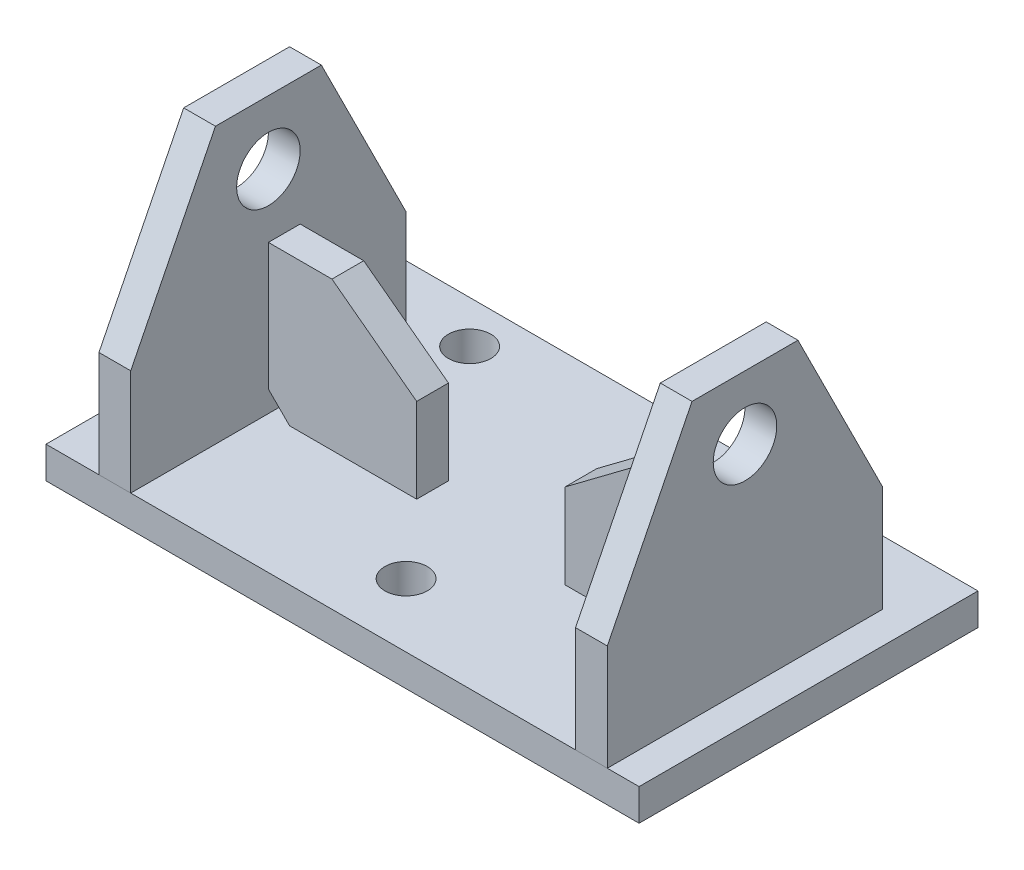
ISO-10303-21;
HEADER;
FILE_DESCRIPTION(('STEP AP214'),'2;1');
FILE_NAME('part.step','',(''),(''),'','','');
FILE_SCHEMA(('AUTOMOTIVE_DESIGN { 1 0 10303 214 1 1 1 1 }'));
ENDSEC;
DATA;
#1=APPLICATION_CONTEXT('core data for automotive mechanical design processes');
#2=APPLICATION_PROTOCOL_DEFINITION('international standard','automotive_design',2000,#1);
#3=PRODUCT_CONTEXT('',#1,'mechanical');
#4=PRODUCT('Part','Part','',(#3));
#5=PRODUCT_RELATED_PRODUCT_CATEGORY('part','',(#4));
#6=PRODUCT_DEFINITION_FORMATION('','',#4);
#7=PRODUCT_DEFINITION_CONTEXT('part definition',#1,'design');
#8=PRODUCT_DEFINITION('design','',#6,#7);
#9=PRODUCT_DEFINITION_SHAPE('','',#8);
#10=(LENGTH_UNIT() NAMED_UNIT(*) SI_UNIT(.MILLI.,.METRE.));
#11=(NAMED_UNIT(*) PLANE_ANGLE_UNIT() SI_UNIT($,.RADIAN.));
#12=(NAMED_UNIT(*) SI_UNIT($,.STERADIAN.) SOLID_ANGLE_UNIT());
#13=UNCERTAINTY_MEASURE_WITH_UNIT(LENGTH_MEASURE(1.E-05),#10,'distance_accuracy_value','');
#14=(GEOMETRIC_REPRESENTATION_CONTEXT(3) GLOBAL_UNCERTAINTY_ASSIGNED_CONTEXT((#13)) GLOBAL_UNIT_ASSIGNED_CONTEXT((#10,
#11,#12)) REPRESENTATION_CONTEXT('',''));
#15=CARTESIAN_POINT('',(0.,0.,0.));
#16=DIRECTION('',(0.,0.,1.));
#17=DIRECTION('',(1.,0.,0.));
#18=AXIS2_PLACEMENT_3D('',#15,#16,#17);
#19=CARTESIAN_POINT('',(69.85,9.525,0.));
#20=DIRECTION('',(1.,0.,0.));
#21=DIRECTION('',(0.,-1.,0.));
#22=AXIS2_PLACEMENT_3D('',#19,#20,#21);
#23=PLANE('',#22);
#24=DIRECTION('',(0.,-1.,0.));
#25=VECTOR('',#24,1.);
#26=CARTESIAN_POINT('',(69.85,9.525,0.));
#27=LINE('',#26,#25);
#28=CARTESIAN_POINT('',(69.8500000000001,53.975,0.));
#29=VERTEX_POINT('',#28);
#30=CARTESIAN_POINT('',(69.85,15.875,0.));
#31=VERTEX_POINT('',#30);
#32=EDGE_CURVE('E119',#29,#31,#27,.T.);
#33=ORIENTED_EDGE('',*,*,#32,.F.);
#34=DIRECTION('',(0.,0.,1.));
#35=VECTOR('',#34,1.);
#36=CARTESIAN_POINT('',(69.8500000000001,53.975,0.));
#37=LINE('',#36,#35);
#38=CARTESIAN_POINT('',(69.8500000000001,53.975,9.525));
#39=VERTEX_POINT('',#38);
#40=EDGE_CURVE('E127',#29,#39,#37,.T.);
#41=ORIENTED_EDGE('',*,*,#40,.T.);
#42=DIRECTION('',(0.,-1.,0.));
#43=VECTOR('',#42,1.);
#44=CARTESIAN_POINT('',(69.85,9.525,9.525));
#45=LINE('',#44,#43);
#46=CARTESIAN_POINT('',(69.85,15.875,9.525));
#47=VERTEX_POINT('',#46);
#48=EDGE_CURVE('E98',#39,#47,#45,.T.);
#49=ORIENTED_EDGE('',*,*,#48,.T.);
#50=DIRECTION('',(0.,0.,1.));
#51=VECTOR('',#50,1.);
#52=CARTESIAN_POINT('',(69.85,15.875,0.));
#53=LINE('',#52,#51);
#54=EDGE_CURVE('E130',#31,#47,#53,.T.);
#55=ORIENTED_EDGE('',*,*,#54,.F.);
#56=EDGE_LOOP('',(#33,#41,#49,#55));
#57=FACE_BOUND('',#56,.T.);
#58=ADVANCED_FACE('F39',(#57),#23,.T.);
#59=CARTESIAN_POINT('',(69.8500000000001,53.975,0.));
#60=DIRECTION('',(0.,1.,0.));
#61=DIRECTION('',(1.,0.,0.));
#62=AXIS2_PLACEMENT_3D('',#59,#60,#61);
#63=PLANE('',#62);
#64=DIRECTION('',(1.,0.,0.));
#65=VECTOR('',#64,1.);
#66=CARTESIAN_POINT('',(69.8500000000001,53.975,9.525));
#67=LINE('',#66,#65);
#68=CARTESIAN_POINT('',(50.8000000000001,53.975,9.525));
#69=VERTEX_POINT('',#68);
#70=EDGE_CURVE('E114',#69,#39,#67,.T.);
#71=ORIENTED_EDGE('',*,*,#70,.T.);
#72=ORIENTED_EDGE('',*,*,#40,.F.);
#73=DIRECTION('',(1.,0.,0.));
#74=VECTOR('',#73,1.);
#75=CARTESIAN_POINT('',(69.8500000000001,53.975,0.));
#76=LINE('',#75,#74);
#77=CARTESIAN_POINT('',(50.8000000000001,53.975,0.));
#78=VERTEX_POINT('',#77);
#79=EDGE_CURVE('E106',#78,#29,#76,.T.);
#80=ORIENTED_EDGE('',*,*,#79,.F.);
#81=DIRECTION('',(0.,0.,1.));
#82=VECTOR('',#81,1.);
#83=CARTESIAN_POINT('',(50.8000000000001,53.975,0.));
#84=LINE('',#83,#82);
#85=EDGE_CURVE('E131',#78,#69,#84,.T.);
#86=ORIENTED_EDGE('',*,*,#85,.T.);
#87=EDGE_LOOP('',(#71,#72,#80,#86));
#88=FACE_BOUND('',#87,.T.);
#89=ADVANCED_FACE('F146',(#88),#63,.T.);
#90=CARTESIAN_POINT('',(50.8000000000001,53.975,0.));
#91=DIRECTION('',(-0.6,0.8,0.));
#92=DIRECTION('',(0.8,0.6,0.));
#93=AXIS2_PLACEMENT_3D('',#90,#91,#92);
#94=PLANE('',#93);
#95=DIRECTION('',(0.8,0.6,0.));
#96=VECTOR('',#95,1.);
#97=CARTESIAN_POINT('',(50.8000000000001,53.975,9.525));
#98=LINE('',#97,#96);
#99=CARTESIAN_POINT('',(25.4000000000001,34.925,9.525));
#100=VERTEX_POINT('',#99);
#101=EDGE_CURVE('E112',#100,#69,#98,.T.);
#102=ORIENTED_EDGE('',*,*,#101,.T.);
#103=ORIENTED_EDGE('',*,*,#85,.F.);
#104=DIRECTION('',(0.8,0.6,0.));
#105=VECTOR('',#104,1.);
#106=CARTESIAN_POINT('',(50.8000000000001,53.975,0.));
#107=LINE('',#106,#105);
#108=CARTESIAN_POINT('',(25.4000000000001,34.925,0.));
#109=VERTEX_POINT('',#108);
#110=EDGE_CURVE('E124',#109,#78,#107,.T.);
#111=ORIENTED_EDGE('',*,*,#110,.F.);
#112=DIRECTION('',(0.,0.,1.));
#113=VECTOR('',#112,1.);
#114=CARTESIAN_POINT('',(25.4000000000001,34.925,0.));
#115=LINE('',#114,#113);
#116=EDGE_CURVE('E105',#109,#100,#115,.T.);
#117=ORIENTED_EDGE('',*,*,#116,.T.);
#118=EDGE_LOOP('',(#102,#103,#111,#117));
#119=FACE_BOUND('',#118,.T.);
#120=ADVANCED_FACE('F142',(#119),#94,.T.);
#121=CARTESIAN_POINT('',(25.4000000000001,34.925,0.));
#122=DIRECTION('',(-1.,0.,0.));
#123=DIRECTION('',(0.,1.,0.));
#124=AXIS2_PLACEMENT_3D('',#121,#122,#123);
#125=PLANE('',#124);
#126=DIRECTION('',(0.,1.,0.));
#127=VECTOR('',#126,1.);
#128=CARTESIAN_POINT('',(25.4000000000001,34.925,9.525));
#129=LINE('',#128,#127);
#130=CARTESIAN_POINT('',(25.4000000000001,9.525,9.525));
#131=VERTEX_POINT('',#130);
#132=EDGE_CURVE('E97',#131,#100,#129,.T.);
#133=ORIENTED_EDGE('',*,*,#132,.T.);
#134=ORIENTED_EDGE('',*,*,#116,.F.);
#135=DIRECTION('',(0.,1.,0.));
#136=VECTOR('',#135,1.);
#137=CARTESIAN_POINT('',(25.4000000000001,34.925,0.));
#138=LINE('',#137,#136);
#139=CARTESIAN_POINT('',(25.4000000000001,9.525,0.));
#140=VERTEX_POINT('',#139);
#141=EDGE_CURVE('E104',#140,#109,#138,.T.);
#142=ORIENTED_EDGE('',*,*,#141,.F.);
#143=DIRECTION('',(0.,0.,1.));
#144=VECTOR('',#143,1.);
#145=CARTESIAN_POINT('',(25.4000000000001,9.525,0.));
#146=LINE('',#145,#144);
#147=EDGE_CURVE('E93',#140,#131,#146,.T.);
#148=ORIENTED_EDGE('',*,*,#147,.T.);
#149=EDGE_LOOP('',(#133,#134,#142,#148));
#150=FACE_BOUND('',#149,.T.);
#151=ADVANCED_FACE('F101',(#150),#125,.T.);
#152=CARTESIAN_POINT('',(69.85,9.525,0.));
#153=DIRECTION('',(0.,-1.,0.));
#154=DIRECTION('',(-1.,0.,0.));
#155=AXIS2_PLACEMENT_3D('',#152,#153,#154);
#156=PLANE('',#155);
#157=DIRECTION('',(-1.,0.,0.));
#158=VECTOR('',#157,1.);
#159=CARTESIAN_POINT('',(69.85,9.525,9.525));
#160=LINE('',#159,#158);
#161=CARTESIAN_POINT('',(63.5,9.525,9.525));
#162=VERTEX_POINT('',#161);
#163=EDGE_CURVE('E89',#162,#131,#160,.T.);
#164=ORIENTED_EDGE('',*,*,#163,.T.);
#165=ORIENTED_EDGE('',*,*,#147,.F.);
#166=DIRECTION('',(-1.,0.,0.));
#167=VECTOR('',#166,1.);
#168=CARTESIAN_POINT('',(69.85,9.525,0.));
#169=LINE('',#168,#167);
#170=CARTESIAN_POINT('',(63.5,9.525,0.));
#171=VERTEX_POINT('',#170);
#172=EDGE_CURVE('E121',#171,#140,#169,.T.);
#173=ORIENTED_EDGE('',*,*,#172,.F.);
#174=DIRECTION('',(0.,0.,-1.));
#175=VECTOR('',#174,1.);
#176=CARTESIAN_POINT('',(63.5,9.525,0.));
#177=LINE('',#176,#175);
#178=EDGE_CURVE('E46',#162,#171,#177,.T.);
#179=ORIENTED_EDGE('',*,*,#178,.F.);
#180=EDGE_LOOP('',(#164,#165,#173,#179));
#181=FACE_BOUND('',#180,.T.);
#182=ADVANCED_FACE('F91',(#181),#156,.T.);
#183=CARTESIAN_POINT('',(69.8500000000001,53.975,0.));
#184=DIRECTION('',(0.,0.,-1.));
#185=DIRECTION('',(1.,0.,0.));
#186=AXIS2_PLACEMENT_3D('',#183,#184,#185);
#187=PLANE('',#186);
#188=ORIENTED_EDGE('',*,*,#172,.T.);
#189=ORIENTED_EDGE('',*,*,#141,.T.);
#190=ORIENTED_EDGE('',*,*,#110,.T.);
#191=ORIENTED_EDGE('',*,*,#79,.T.);
#192=ORIENTED_EDGE('',*,*,#32,.T.);
#193=DIRECTION('',(-0.707106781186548,-0.707106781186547,0.));
#194=VECTOR('',#193,1.);
#195=CARTESIAN_POINT('',(88.9,34.925,0.));
#196=LINE('',#195,#194);
#197=EDGE_CURVE('E12',#171,#31,#196,.F.);
#198=ORIENTED_EDGE('',*,*,#197,.F.);
#199=EDGE_LOOP('',(#188,#189,#190,#191,#192,#198));
#200=FACE_BOUND('',#199,.T.);
#201=ADVANCED_FACE('F138',(#200),#187,.T.);
#202=CARTESIAN_POINT('',(69.8500000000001,53.975,9.525));
#203=DIRECTION('',(0.,0.,-1.));
#204=DIRECTION('',(1.,0.,0.));
#205=AXIS2_PLACEMENT_3D('',#202,#203,#204);
#206=PLANE('',#205);
#207=ORIENTED_EDGE('',*,*,#48,.F.);
#208=ORIENTED_EDGE('',*,*,#70,.F.);
#209=ORIENTED_EDGE('',*,*,#101,.F.);
#210=ORIENTED_EDGE('',*,*,#132,.F.);
#211=ORIENTED_EDGE('',*,*,#163,.F.);
#212=DIRECTION('',(0.707106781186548,0.707106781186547,0.));
#213=VECTOR('',#212,1.);
#214=CARTESIAN_POINT('',(69.85,15.875,9.525));
#215=LINE('',#214,#213);
#216=EDGE_CURVE('E58',#47,#162,#215,.F.);
#217=ORIENTED_EDGE('',*,*,#216,.F.);
#218=EDGE_LOOP('',(#207,#208,#209,#210,#211,#217));
#219=FACE_BOUND('',#218,.T.);
#220=ADVANCED_FACE('F110',(#219),#206,.F.);
#221=CARTESIAN_POINT('',(69.85,15.875,0.));
#222=DIRECTION('',(-0.707106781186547,0.707106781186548,0.));
#223=DIRECTION('',(0.707106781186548,0.707106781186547,0.));
#224=AXIS2_PLACEMENT_3D('',#221,#222,#223);
#225=PLANE('',#224);
#226=ORIENTED_EDGE('',*,*,#197,.T.);
#227=ORIENTED_EDGE('',*,*,#54,.T.);
#228=ORIENTED_EDGE('',*,*,#216,.T.);
#229=ORIENTED_EDGE('',*,*,#178,.T.);
#230=EDGE_LOOP('',(#226,#227,#228,#229));
#231=FACE_BOUND('',#230,.T.);
#232=ADVANCED_FACE('F136',(#231),#225,.F.);
#233=CLOSED_SHELL('',(#58,#89,#120,#151,#182,#201,#220,#232));
#234=MANIFOLD_SOLID_BREP('B2',#233);
#235=CARTESIAN_POINT('',(69.85,9.525,50.8));
#236=DIRECTION('',(0.,0.,1.));
#237=DIRECTION('',(-1.,0.,0.));
#238=AXIS2_PLACEMENT_3D('',#235,#236,#237);
#239=PLANE('',#238);
#240=DIRECTION('',(0.,1.,0.));
#241=VECTOR('',#240,1.);
#242=CARTESIAN_POINT('',(79.375,9.525,50.8));
#243=LINE('',#242,#241);
#244=CARTESIAN_POINT('',(79.375,9.525,50.8));
#245=VERTEX_POINT('',#244);
#246=CARTESIAN_POINT('',(79.375,41.275,50.8));
#247=VERTEX_POINT('',#246);
#248=EDGE_CURVE('E267',#245,#247,#243,.T.);
#249=ORIENTED_EDGE('',*,*,#248,.T.);
#250=DIRECTION('',(1.,0.,0.));
#251=VECTOR('',#250,1.);
#252=CARTESIAN_POINT('',(69.85,41.275,50.8));
#253=LINE('',#252,#251);
#254=CARTESIAN_POINT('',(69.85,41.275,50.8));
#255=VERTEX_POINT('',#254);
#256=EDGE_CURVE('E211',#255,#247,#253,.T.);
#257=ORIENTED_EDGE('',*,*,#256,.F.);
#258=DIRECTION('',(0.,1.,0.));
#259=VECTOR('',#258,1.);
#260=CARTESIAN_POINT('',(69.85,9.525,50.8));
#261=LINE('',#260,#259);
#262=CARTESIAN_POINT('',(69.85,9.525,50.8));
#263=VERTEX_POINT('',#262);
#264=EDGE_CURVE('E294',#263,#255,#261,.T.);
#265=ORIENTED_EDGE('',*,*,#264,.F.);
#266=DIRECTION('',(1.,0.,0.));
#267=VECTOR('',#266,1.);
#268=CARTESIAN_POINT('',(69.85,9.525,50.8));
#269=LINE('',#268,#267);
#270=EDGE_CURVE('E37',#263,#245,#269,.T.);
#271=ORIENTED_EDGE('',*,*,#270,.T.);
#272=EDGE_LOOP('',(#249,#257,#265,#271));
#273=FACE_BOUND('',#272,.T.);
#274=ADVANCED_FACE('F208',(#273),#239,.T.);
#275=CARTESIAN_POINT('',(69.85,9.525,50.8));
#276=DIRECTION('',(0.,-1.,0.));
#277=DIRECTION('',(0.,0.,-1.));
#278=AXIS2_PLACEMENT_3D('',#275,#276,#277);
#279=PLANE('',#278);
#280=DIRECTION('',(0.,0.,1.));
#281=VECTOR('',#280,1.);
#282=CARTESIAN_POINT('',(79.375,9.525,50.8));
#283=LINE('',#282,#281);
#284=CARTESIAN_POINT('',(79.375,9.525,-31.75));
#285=VERTEX_POINT('',#284);
#286=EDGE_CURVE('E292',#285,#245,#283,.T.);
#287=ORIENTED_EDGE('',*,*,#286,.T.);
#288=ORIENTED_EDGE('',*,*,#270,.F.);
#289=DIRECTION('',(0.,0.,1.));
#290=VECTOR('',#289,1.);
#291=CARTESIAN_POINT('',(69.85,9.525,50.8));
#292=LINE('',#291,#290);
#293=CARTESIAN_POINT('',(69.85,9.525,-31.75));
#294=VERTEX_POINT('',#293);
#295=EDGE_CURVE('E224',#294,#263,#292,.T.);
#296=ORIENTED_EDGE('',*,*,#295,.F.);
#297=DIRECTION('',(1.,0.,0.));
#298=VECTOR('',#297,1.);
#299=CARTESIAN_POINT('',(69.85,9.525,-31.75));
#300=LINE('',#299,#298);
#301=EDGE_CURVE('E216',#294,#285,#300,.T.);
#302=ORIENTED_EDGE('',*,*,#301,.T.);
#303=EDGE_LOOP('',(#287,#288,#296,#302));
#304=FACE_BOUND('',#303,.T.);
#305=ADVANCED_FACE('F323',(#304),#279,.T.);
#306=CARTESIAN_POINT('',(69.85,9.525,-31.75));
#307=DIRECTION('',(0.,0.,-1.));
#308=DIRECTION('',(1.,0.,0.));
#309=AXIS2_PLACEMENT_3D('',#306,#307,#308);
#310=PLANE('',#309);
#311=DIRECTION('',(0.,-1.,0.));
#312=VECTOR('',#311,1.);
#313=CARTESIAN_POINT('',(79.375,9.525,-31.75));
#314=LINE('',#313,#312);
#315=CARTESIAN_POINT('',(79.375,41.275,-31.75));
#316=VERTEX_POINT('',#315);
#317=EDGE_CURVE('E290',#316,#285,#314,.T.);
#318=ORIENTED_EDGE('',*,*,#317,.T.);
#319=ORIENTED_EDGE('',*,*,#301,.F.);
#320=DIRECTION('',(0.,-1.,0.));
#321=VECTOR('',#320,1.);
#322=CARTESIAN_POINT('',(69.85,9.525,-31.75));
#323=LINE('',#322,#321);
#324=CARTESIAN_POINT('',(69.85,41.275,-31.75));
#325=VERTEX_POINT('',#324);
#326=EDGE_CURVE('E229',#325,#294,#323,.T.);
#327=ORIENTED_EDGE('',*,*,#326,.F.);
#328=DIRECTION('',(1.,0.,0.));
#329=VECTOR('',#328,1.);
#330=CARTESIAN_POINT('',(69.85,41.275,-31.75));
#331=LINE('',#330,#329);
#332=EDGE_CURVE('E305',#325,#316,#331,.T.);
#333=ORIENTED_EDGE('',*,*,#332,.T.);
#334=EDGE_LOOP('',(#318,#319,#327,#333));
#335=FACE_BOUND('',#334,.T.);
#336=ADVANCED_FACE('F321',(#335),#310,.T.);
#337=CARTESIAN_POINT('',(69.85,41.275,-31.75));
#338=DIRECTION('',(0.,0.447213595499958,-0.894427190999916));
#339=DIRECTION('',(0.,0.894427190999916,0.447213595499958));
#340=AXIS2_PLACEMENT_3D('',#337,#338,#339);
#341=PLANE('',#340);
#342=DIRECTION('',(0.,-0.894427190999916,-0.447213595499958));
#343=VECTOR('',#342,1.);
#344=CARTESIAN_POINT('',(79.375,41.275,-31.75));
#345=LINE('',#344,#343);
#346=CARTESIAN_POINT('',(79.375,92.075,-6.35000000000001));
#347=VERTEX_POINT('',#346);
#348=EDGE_CURVE('E288',#347,#316,#345,.T.);
#349=ORIENTED_EDGE('',*,*,#348,.T.);
#350=ORIENTED_EDGE('',*,*,#332,.F.);
#351=DIRECTION('',(0.,-0.894427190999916,-0.447213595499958));
#352=VECTOR('',#351,1.);
#353=CARTESIAN_POINT('',(69.85,41.275,-31.75));
#354=LINE('',#353,#352);
#355=CARTESIAN_POINT('',(69.85,92.075,-6.35000000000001));
#356=VERTEX_POINT('',#355);
#357=EDGE_CURVE('E299',#356,#325,#354,.T.);
#358=ORIENTED_EDGE('',*,*,#357,.F.);
#359=DIRECTION('',(1.,0.,0.));
#360=VECTOR('',#359,1.);
#361=CARTESIAN_POINT('',(69.85,92.075,-6.35000000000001));
#362=LINE('',#361,#360);
#363=EDGE_CURVE('E308',#356,#347,#362,.T.);
#364=ORIENTED_EDGE('',*,*,#363,.T.);
#365=EDGE_LOOP('',(#349,#350,#358,#364));
#366=FACE_BOUND('',#365,.T.);
#367=ADVANCED_FACE('F318',(#366),#341,.T.);
#368=CARTESIAN_POINT('',(69.85,92.075,-6.35000000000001));
#369=DIRECTION('',(0.,1.,0.));
#370=DIRECTION('',(0.,0.,1.));
#371=AXIS2_PLACEMENT_3D('',#368,#369,#370);
#372=PLANE('',#371);
#373=DIRECTION('',(0.,0.,-1.));
#374=VECTOR('',#373,1.);
#375=CARTESIAN_POINT('',(79.375,92.075,-6.35000000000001));
#376=LINE('',#375,#374);
#377=CARTESIAN_POINT('',(79.375,92.075,25.4));
#378=VERTEX_POINT('',#377);
#379=EDGE_CURVE('E269',#378,#347,#376,.T.);
#380=ORIENTED_EDGE('',*,*,#379,.T.);
#381=ORIENTED_EDGE('',*,*,#363,.F.);
#382=DIRECTION('',(0.,0.,-1.));
#383=VECTOR('',#382,1.);
#384=CARTESIAN_POINT('',(69.85,92.075,-6.35000000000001));
#385=LINE('',#384,#383);
#386=CARTESIAN_POINT('',(69.85,92.075,25.4));
#387=VERTEX_POINT('',#386);
#388=EDGE_CURVE('E297',#387,#356,#385,.T.);
#389=ORIENTED_EDGE('',*,*,#388,.F.);
#390=DIRECTION('',(1.,0.,0.));
#391=VECTOR('',#390,1.);
#392=CARTESIAN_POINT('',(69.85,92.075,25.4));
#393=LINE('',#392,#391);
#394=EDGE_CURVE('E279',#387,#378,#393,.T.);
#395=ORIENTED_EDGE('',*,*,#394,.T.);
#396=EDGE_LOOP('',(#380,#381,#389,#395));
#397=FACE_BOUND('',#396,.T.);
#398=ADVANCED_FACE('F312',(#397),#372,.T.);
#399=CARTESIAN_POINT('',(69.85,92.075,25.4));
#400=DIRECTION('',(0.,0.447213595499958,0.894427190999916));
#401=DIRECTION('',(0.,-0.894427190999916,0.447213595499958));
#402=AXIS2_PLACEMENT_3D('',#399,#400,#401);
#403=PLANE('',#402);
#404=DIRECTION('',(0.,0.894427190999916,-0.447213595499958));
#405=VECTOR('',#404,1.);
#406=CARTESIAN_POINT('',(79.375,92.075,25.4));
#407=LINE('',#406,#405);
#408=EDGE_CURVE('E262',#247,#378,#407,.T.);
#409=ORIENTED_EDGE('',*,*,#408,.T.);
#410=ORIENTED_EDGE('',*,*,#394,.F.);
#411=DIRECTION('',(0.,0.894427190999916,-0.447213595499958));
#412=VECTOR('',#411,1.);
#413=CARTESIAN_POINT('',(69.85,92.075,25.4));
#414=LINE('',#413,#412);
#415=EDGE_CURVE('E276',#255,#387,#414,.T.);
#416=ORIENTED_EDGE('',*,*,#415,.F.);
#417=ORIENTED_EDGE('',*,*,#256,.T.);
#418=EDGE_LOOP('',(#409,#410,#416,#417));
#419=FACE_BOUND('',#418,.T.);
#420=ADVANCED_FACE('F275',(#419),#403,.T.);
#421=CARTESIAN_POINT('',(69.85,92.075,50.8));
#422=DIRECTION('',(-1.,0.,0.));
#423=DIRECTION('',(0.,0.,-1.));
#424=AXIS2_PLACEMENT_3D('',#421,#422,#423);
#425=PLANE('',#424);
#426=CARTESIAN_POINT('',(69.85,73.025,9.52499999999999));
#427=DIRECTION('',(-1.,0.,0.));
#428=DIRECTION('',(0.,0.,1.));
#429=AXIS2_PLACEMENT_3D('',#426,#427,#428);
#430=CIRCLE('',#429,9.525);
#431=CARTESIAN_POINT('',(69.85,73.025,19.05));
#432=VERTEX_POINT('',#431);
#433=EDGE_CURVE('E280',#432,#432,#430,.T.);
#434=ORIENTED_EDGE('',*,*,#433,.F.);
#435=EDGE_LOOP('',(#434));
#436=FACE_BOUND('',#435,.T.);
#437=ORIENTED_EDGE('',*,*,#264,.T.);
#438=ORIENTED_EDGE('',*,*,#415,.T.);
#439=ORIENTED_EDGE('',*,*,#388,.T.);
#440=ORIENTED_EDGE('',*,*,#357,.T.);
#441=ORIENTED_EDGE('',*,*,#326,.T.);
#442=ORIENTED_EDGE('',*,*,#295,.T.);
#443=EDGE_LOOP('',(#437,#438,#439,#440,#441,#442));
#444=FACE_BOUND('',#443,.T.);
#445=ADVANCED_FACE('F315',(#436,#444),#425,.T.);
#446=CARTESIAN_POINT('',(79.375,92.075,50.8));
#447=DIRECTION('',(-1.,0.,0.));
#448=DIRECTION('',(0.,0.,-1.));
#449=AXIS2_PLACEMENT_3D('',#446,#447,#448);
#450=PLANE('',#449);
#451=CARTESIAN_POINT('',(79.375,73.025,9.52499999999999));
#452=DIRECTION('',(-1.,0.,0.));
#453=DIRECTION('',(0.,0.,1.));
#454=AXIS2_PLACEMENT_3D('',#451,#452,#453);
#455=CIRCLE('',#454,9.525);
#456=CARTESIAN_POINT('',(79.375,73.025,19.05));
#457=VERTEX_POINT('',#456);
#458=EDGE_CURVE('E283',#457,#457,#455,.T.);
#459=ORIENTED_EDGE('',*,*,#458,.T.);
#460=EDGE_LOOP('',(#459));
#461=FACE_BOUND('',#460,.T.);
#462=ORIENTED_EDGE('',*,*,#248,.F.);
#463=ORIENTED_EDGE('',*,*,#286,.F.);
#464=ORIENTED_EDGE('',*,*,#317,.F.);
#465=ORIENTED_EDGE('',*,*,#348,.F.);
#466=ORIENTED_EDGE('',*,*,#379,.F.);
#467=ORIENTED_EDGE('',*,*,#408,.F.);
#468=EDGE_LOOP('',(#462,#463,#464,#465,#466,#467));
#469=FACE_BOUND('',#468,.T.);
#470=ADVANCED_FACE('F264',(#461,#469),#450,.F.);
#471=CARTESIAN_POINT('',(69.85,73.025,9.52499999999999));
#472=DIRECTION('',(1.,0.,0.));
#473=DIRECTION('',(0.,0.,1.));
#474=AXIS2_PLACEMENT_3D('',#471,#472,#473);
#475=CYLINDRICAL_SURFACE('',#474,9.525);
#476=CARTESIAN_POINT('',(69.85,73.025,19.05));
#477=CARTESIAN_POINT('',(69.94921875,73.025,19.05));
#478=CARTESIAN_POINT('',(70.0484375,73.025,19.05));
#479=CARTESIAN_POINT('',(70.246875,73.025,19.05));
#480=CARTESIAN_POINT('',(70.34609375,73.025,19.05));
#481=CARTESIAN_POINT('',(70.54453125,73.025,19.05));
#482=CARTESIAN_POINT('',(70.64375,73.025,19.05));
#483=CARTESIAN_POINT('',(70.8421875,73.025,19.05));
#484=CARTESIAN_POINT('',(70.94140625,73.025,19.05));
#485=CARTESIAN_POINT('',(71.13984375,73.025,19.05));
#486=CARTESIAN_POINT('',(71.2390625,73.025,19.05));
#487=CARTESIAN_POINT('',(71.4375,73.025,19.05));
#488=CARTESIAN_POINT('',(71.53671875,73.025,19.05));
#489=CARTESIAN_POINT('',(71.73515625,73.025,19.05));
#490=CARTESIAN_POINT('',(71.834375,73.025,19.05));
#491=CARTESIAN_POINT('',(72.0328125,73.025,19.05));
#492=CARTESIAN_POINT('',(72.13203125,73.025,19.05));
#493=CARTESIAN_POINT('',(72.33046875,73.025,19.05));
#494=CARTESIAN_POINT('',(72.4296875,73.025,19.05));
#495=CARTESIAN_POINT('',(72.628125,73.025,19.05));
#496=CARTESIAN_POINT('',(72.72734375,73.025,19.05));
#497=CARTESIAN_POINT('',(72.92578125,73.025,19.05));
#498=CARTESIAN_POINT('',(73.025,73.025,19.05));
#499=CARTESIAN_POINT('',(73.2234375,73.025,19.05));
#500=CARTESIAN_POINT('',(73.32265625,73.025,19.05));
#501=CARTESIAN_POINT('',(73.52109375,73.025,19.05));
#502=CARTESIAN_POINT('',(73.6203125,73.025,19.05));
#503=CARTESIAN_POINT('',(73.8187500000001,73.025,19.05));
#504=CARTESIAN_POINT('',(73.91796875,73.025,19.05));
#505=CARTESIAN_POINT('',(74.11640625,73.025,19.05));
#506=CARTESIAN_POINT('',(74.215625,73.025,19.05));
#507=CARTESIAN_POINT('',(74.4140625,73.025,19.05));
#508=CARTESIAN_POINT('',(74.51328125,73.025,19.05));
#509=CARTESIAN_POINT('',(74.71171875,73.025,19.05));
#510=CARTESIAN_POINT('',(74.8109375,73.025,19.05));
#511=CARTESIAN_POINT('',(75.009375,73.025,19.05));
#512=CARTESIAN_POINT('',(75.10859375,73.025,19.05));
#513=CARTESIAN_POINT('',(75.3070312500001,73.025,19.05));
#514=CARTESIAN_POINT('',(75.40625,73.025,19.05));
#515=CARTESIAN_POINT('',(75.6046875,73.025,19.05));
#516=CARTESIAN_POINT('',(75.70390625,73.025,19.05));
#517=CARTESIAN_POINT('',(75.90234375,73.025,19.05));
#518=CARTESIAN_POINT('',(76.0015625,73.025,19.05));
#519=CARTESIAN_POINT('',(76.2,73.025,19.05));
#520=CARTESIAN_POINT('',(76.29921875,73.025,19.05));
#521=CARTESIAN_POINT('',(76.49765625,73.025,19.05));
#522=CARTESIAN_POINT('',(76.596875,73.025,19.05));
#523=CARTESIAN_POINT('',(76.7953125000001,73.025,19.05));
#524=CARTESIAN_POINT('',(76.89453125,73.025,19.05));
#525=CARTESIAN_POINT('',(77.09296875,73.025,19.05));
#526=CARTESIAN_POINT('',(77.1921875,73.025,19.05));
#527=CARTESIAN_POINT('',(77.390625,73.025,19.05));
#528=CARTESIAN_POINT('',(77.48984375,73.025,19.05));
#529=CARTESIAN_POINT('',(77.68828125,73.025,19.05));
#530=CARTESIAN_POINT('',(77.7875,73.025,19.05));
#531=CARTESIAN_POINT('',(77.9859375,73.025,19.05));
#532=CARTESIAN_POINT('',(78.08515625,73.025,19.05));
#533=CARTESIAN_POINT('',(78.2835937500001,73.025,19.05));
#534=CARTESIAN_POINT('',(78.3828125,73.025,19.05));
#535=CARTESIAN_POINT('',(78.58125,73.025,19.05));
#536=CARTESIAN_POINT('',(78.68046875,73.025,19.05));
#537=CARTESIAN_POINT('',(78.87890625,73.025,19.05));
#538=CARTESIAN_POINT('',(78.978125,73.025,19.05));
#539=CARTESIAN_POINT('',(79.1765625,73.025,19.05));
#540=CARTESIAN_POINT('',(79.27578125,73.025,19.05));
#541=CARTESIAN_POINT('',(79.375,73.025,19.05));
#542=B_SPLINE_CURVE_WITH_KNOTS('',3,(#476,#477,#478,#479,#480,#481,#482,#483,#484,#485,#486,
#487,#488,#489,#490,#491,#492,#493,#494,#495,#496,#497,#498,#499,#500,#501,#502,#503,#504,#505,
#506,#507,#508,#509,#510,#511,#512,#513,#514,#515,#516,#517,#518,#519,#520,#521,#522,#523,#524,
#525,#526,#527,#528,#529,#530,#531,#532,#533,#534,#535,#536,#537,#538,#539,#540,#541),
.UNSPECIFIED.,.F.,.F.,(4,2,2,2,2,2,2,2,2,2,2,2,2,2,2,2,2,2,2,2,2,2,2,2,2,2,2,2,2,2,2,2,4),(0.,
0.29765625,0.5953125,0.892968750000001,1.190625,1.48828125,1.7859375,2.08359375,2.38125,
2.67890625,2.9765625,3.27421875,3.571875,3.86953125,4.1671875,4.46484375,4.7625,5.06015625,
5.3578125,5.65546875,5.953125,6.25078125,6.5484375,6.84609375,7.14375,7.44140625,7.7390625,
8.03671875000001,8.334375,8.63203125,8.92968750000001,9.22734375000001,9.52500000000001),.UNSPECIFIED.);
#543=EDGE_CURVE('BSEAM345',#432,#457,#542,.T.);
#544=ORIENTED_EDGE('',*,*,#433,.T.);
#545=ORIENTED_EDGE('',*,*,#458,.F.);
#546=ORIENTED_EDGE('',*,*,#543,.T.);
#547=ORIENTED_EDGE('',*,*,#543,.F.);
#548=EDGE_LOOP('',(#544,#546,#545,#547));
#549=FACE_BOUND('',#548,.T.);
#550=ADVANCED_FACE('F345',(#549),#475,.F.);
#551=CLOSED_SHELL('',(#274,#305,#336,#367,#398,#420,#445,#470,#550));
#552=MANIFOLD_SOLID_BREP('B6',#551);
#553=CARTESIAN_POINT('',(-63.5,9.525,0.));
#554=DIRECTION('',(-1.,0.,0.));
#555=DIRECTION('',(0.,-1.,0.));
#556=AXIS2_PLACEMENT_3D('',#553,#554,#555);
#557=PLANE('',#556);
#558=DIRECTION('',(0.,-1.,0.));
#559=VECTOR('',#558,1.);
#560=CARTESIAN_POINT('',(-63.5,9.525,0.));
#561=LINE('',#560,#559);
#562=CARTESIAN_POINT('',(-63.5,53.975,0.));
#563=VERTEX_POINT('',#562);
#564=CARTESIAN_POINT('',(-63.5,15.875,0.));
#565=VERTEX_POINT('',#564);
#566=EDGE_CURVE('E472',#563,#565,#561,.T.);
#567=ORIENTED_EDGE('',*,*,#566,.T.);
#568=DIRECTION('',(0.,0.,1.));
#569=VECTOR('',#568,1.);
#570=CARTESIAN_POINT('',(-63.5,15.875,0.));
#571=LINE('',#570,#569);
#572=CARTESIAN_POINT('',(-63.5,15.875,9.525));
#573=VERTEX_POINT('',#572);
#574=EDGE_CURVE('E485',#565,#573,#571,.T.);
#575=ORIENTED_EDGE('',*,*,#574,.T.);
#576=DIRECTION('',(0.,-1.,0.));
#577=VECTOR('',#576,1.);
#578=CARTESIAN_POINT('',(-63.5,9.525,9.525));
#579=LINE('',#578,#577);
#580=CARTESIAN_POINT('',(-63.5,53.975,9.525));
#581=VERTEX_POINT('',#580);
#582=EDGE_CURVE('E450',#581,#573,#579,.T.);
#583=ORIENTED_EDGE('',*,*,#582,.F.);
#584=DIRECTION('',(0.,0.,1.));
#585=VECTOR('',#584,1.);
#586=CARTESIAN_POINT('',(-63.5,53.975,0.));
#587=LINE('',#586,#585);
#588=EDGE_CURVE('E483',#563,#581,#587,.T.);
#589=ORIENTED_EDGE('',*,*,#588,.F.);
#590=EDGE_LOOP('',(#567,#575,#583,#589));
#591=FACE_BOUND('',#590,.T.);
#592=ADVANCED_FACE('F396',(#591),#557,.T.);
#593=CARTESIAN_POINT('',(-63.5,53.975,0.));
#594=DIRECTION('',(0.,1.,0.));
#595=DIRECTION('',(-1.,0.,0.));
#596=AXIS2_PLACEMENT_3D('',#593,#594,#595);
#597=PLANE('',#596);
#598=DIRECTION('',(-1.,0.,0.));
#599=VECTOR('',#598,1.);
#600=CARTESIAN_POINT('',(-63.5,53.975,9.525));
#601=LINE('',#600,#599);
#602=CARTESIAN_POINT('',(-44.45,53.975,9.525));
#603=VERTEX_POINT('',#602);
#604=EDGE_CURVE('E466',#603,#581,#601,.T.);
#605=ORIENTED_EDGE('',*,*,#604,.F.);
#606=DIRECTION('',(0.,0.,1.));
#607=VECTOR('',#606,1.);
#608=CARTESIAN_POINT('',(-44.45,53.975,0.));
#609=LINE('',#608,#607);
#610=CARTESIAN_POINT('',(-44.45,53.975,0.));
#611=VERTEX_POINT('',#610);
#612=EDGE_CURVE('E486',#611,#603,#609,.T.);
#613=ORIENTED_EDGE('',*,*,#612,.F.);
#614=DIRECTION('',(-1.,0.,0.));
#615=VECTOR('',#614,1.);
#616=CARTESIAN_POINT('',(-63.5,53.975,0.));
#617=LINE('',#616,#615);
#618=EDGE_CURVE('E460',#611,#563,#617,.T.);
#619=ORIENTED_EDGE('',*,*,#618,.T.);
#620=ORIENTED_EDGE('',*,*,#588,.T.);
#621=EDGE_LOOP('',(#605,#613,#619,#620));
#622=FACE_BOUND('',#621,.T.);
#623=ADVANCED_FACE('F499',(#622),#597,.T.);
#624=CARTESIAN_POINT('',(-44.45,53.975,0.));
#625=DIRECTION('',(0.6,0.8,0.));
#626=DIRECTION('',(-0.8,0.6,0.));
#627=AXIS2_PLACEMENT_3D('',#624,#625,#626);
#628=PLANE('',#627);
#629=DIRECTION('',(-0.8,0.6,0.));
#630=VECTOR('',#629,1.);
#631=CARTESIAN_POINT('',(-44.45,53.975,9.525));
#632=LINE('',#631,#630);
#633=CARTESIAN_POINT('',(-19.05,34.925,9.525));
#634=VERTEX_POINT('',#633);
#635=EDGE_CURVE('E464',#634,#603,#632,.T.);
#636=ORIENTED_EDGE('',*,*,#635,.F.);
#637=DIRECTION('',(0.,0.,1.));
#638=VECTOR('',#637,1.);
#639=CARTESIAN_POINT('',(-19.05,34.925,0.));
#640=LINE('',#639,#638);
#641=CARTESIAN_POINT('',(-19.05,34.925,0.));
#642=VERTEX_POINT('',#641);
#643=EDGE_CURVE('E459',#642,#634,#640,.T.);
#644=ORIENTED_EDGE('',*,*,#643,.F.);
#645=DIRECTION('',(-0.8,0.6,0.));
#646=VECTOR('',#645,1.);
#647=CARTESIAN_POINT('',(-44.45,53.975,0.));
#648=LINE('',#647,#646);
#649=EDGE_CURVE('E478',#642,#611,#648,.T.);
#650=ORIENTED_EDGE('',*,*,#649,.T.);
#651=ORIENTED_EDGE('',*,*,#612,.T.);
#652=EDGE_LOOP('',(#636,#644,#650,#651));
#653=FACE_BOUND('',#652,.T.);
#654=ADVANCED_FACE('F517',(#653),#628,.T.);
#655=CARTESIAN_POINT('',(-19.05,34.925,0.));
#656=DIRECTION('',(1.,0.,0.));
#657=DIRECTION('',(0.,1.,0.));
#658=AXIS2_PLACEMENT_3D('',#655,#656,#657);
#659=PLANE('',#658);
#660=DIRECTION('',(0.,1.,0.));
#661=VECTOR('',#660,1.);
#662=CARTESIAN_POINT('',(-19.05,34.925,9.525));
#663=LINE('',#662,#661);
#664=CARTESIAN_POINT('',(-19.05,9.525,9.525));
#665=VERTEX_POINT('',#664);
#666=EDGE_CURVE('E449',#665,#634,#663,.T.);
#667=ORIENTED_EDGE('',*,*,#666,.F.);
#668=DIRECTION('',(0.,0.,1.));
#669=VECTOR('',#668,1.);
#670=CARTESIAN_POINT('',(-19.05,9.525,0.));
#671=LINE('',#670,#669);
#672=CARTESIAN_POINT('',(-19.05,9.525,0.));
#673=VERTEX_POINT('',#672);
#674=EDGE_CURVE('E453',#673,#665,#671,.T.);
#675=ORIENTED_EDGE('',*,*,#674,.F.);
#676=DIRECTION('',(0.,1.,0.));
#677=VECTOR('',#676,1.);
#678=CARTESIAN_POINT('',(-19.05,34.925,0.));
#679=LINE('',#678,#677);
#680=EDGE_CURVE('E476',#673,#642,#679,.T.);
#681=ORIENTED_EDGE('',*,*,#680,.T.);
#682=ORIENTED_EDGE('',*,*,#643,.T.);
#683=EDGE_LOOP('',(#667,#675,#681,#682));
#684=FACE_BOUND('',#683,.T.);
#685=ADVANCED_FACE('F462',(#684),#659,.T.);
#686=CARTESIAN_POINT('',(-63.5,9.525,0.));
#687=DIRECTION('',(0.,-1.,0.));
#688=DIRECTION('',(1.,0.,0.));
#689=AXIS2_PLACEMENT_3D('',#686,#687,#688);
#690=PLANE('',#689);
#691=DIRECTION('',(1.,0.,0.));
#692=VECTOR('',#691,1.);
#693=CARTESIAN_POINT('',(-63.5,9.525,9.525));
#694=LINE('',#693,#692);
#695=CARTESIAN_POINT('',(-57.1499999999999,9.525,9.525));
#696=VERTEX_POINT('',#695);
#697=EDGE_CURVE('E444',#696,#665,#694,.T.);
#698=ORIENTED_EDGE('',*,*,#697,.F.);
#699=DIRECTION('',(0.,0.,-1.));
#700=VECTOR('',#699,1.);
#701=CARTESIAN_POINT('',(-57.1499999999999,9.525,0.));
#702=LINE('',#701,#700);
#703=CARTESIAN_POINT('',(-57.1499999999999,9.525,0.));
#704=VERTEX_POINT('',#703);
#705=EDGE_CURVE('E403',#696,#704,#702,.T.);
#706=ORIENTED_EDGE('',*,*,#705,.T.);
#707=DIRECTION('',(1.,0.,0.));
#708=VECTOR('',#707,1.);
#709=CARTESIAN_POINT('',(-63.5,9.525,0.));
#710=LINE('',#709,#708);
#711=EDGE_CURVE('E455',#704,#673,#710,.T.);
#712=ORIENTED_EDGE('',*,*,#711,.T.);
#713=ORIENTED_EDGE('',*,*,#674,.T.);
#714=EDGE_LOOP('',(#698,#706,#712,#713));
#715=FACE_BOUND('',#714,.T.);
#716=ADVANCED_FACE('F454',(#715),#690,.T.);
#717=CARTESIAN_POINT('',(-63.5,53.975,0.));
#718=DIRECTION('',(0.,0.,-1.));
#719=DIRECTION('',(-1.,0.,0.));
#720=AXIS2_PLACEMENT_3D('',#717,#718,#719);
#721=PLANE('',#720);
#722=ORIENTED_EDGE('',*,*,#711,.F.);
#723=DIRECTION('',(0.707106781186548,-0.707106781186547,0.));
#724=VECTOR('',#723,1.);
#725=CARTESIAN_POINT('',(-82.55,34.925,0.));
#726=LINE('',#725,#724);
#727=EDGE_CURVE('E206',#704,#565,#726,.F.);
#728=ORIENTED_EDGE('',*,*,#727,.T.);
#729=ORIENTED_EDGE('',*,*,#566,.F.);
#730=ORIENTED_EDGE('',*,*,#618,.F.);
#731=ORIENTED_EDGE('',*,*,#649,.F.);
#732=ORIENTED_EDGE('',*,*,#680,.F.);
#733=EDGE_LOOP('',(#722,#728,#729,#730,#731,#732));
#734=FACE_BOUND('',#733,.T.);
#735=ADVANCED_FACE('F502',(#734),#721,.T.);
#736=CARTESIAN_POINT('',(-63.5,53.975,9.525));
#737=DIRECTION('',(0.,0.,-1.));
#738=DIRECTION('',(-1.,0.,0.));
#739=AXIS2_PLACEMENT_3D('',#736,#737,#738);
#740=PLANE('',#739);
#741=ORIENTED_EDGE('',*,*,#582,.T.);
#742=DIRECTION('',(-0.707106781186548,0.707106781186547,0.));
#743=VECTOR('',#742,1.);
#744=CARTESIAN_POINT('',(-63.5,15.875,9.525));
#745=LINE('',#744,#743);
#746=EDGE_CURVE('E417',#573,#696,#745,.F.);
#747=ORIENTED_EDGE('',*,*,#746,.T.);
#748=ORIENTED_EDGE('',*,*,#697,.T.);
#749=ORIENTED_EDGE('',*,*,#666,.T.);
#750=ORIENTED_EDGE('',*,*,#635,.T.);
#751=ORIENTED_EDGE('',*,*,#604,.T.);
#752=EDGE_LOOP('',(#741,#747,#748,#749,#750,#751));
#753=FACE_BOUND('',#752,.T.);
#754=ADVANCED_FACE('F446',(#753),#740,.F.);
#755=CARTESIAN_POINT('',(-63.5,15.875,0.));
#756=DIRECTION('',(0.707106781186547,0.707106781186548,0.));
#757=DIRECTION('',(-0.707106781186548,0.707106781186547,0.));
#758=AXIS2_PLACEMENT_3D('',#755,#756,#757);
#759=PLANE('',#758);
#760=ORIENTED_EDGE('',*,*,#727,.F.);
#761=ORIENTED_EDGE('',*,*,#705,.F.);
#762=ORIENTED_EDGE('',*,*,#746,.F.);
#763=ORIENTED_EDGE('',*,*,#574,.F.);
#764=EDGE_LOOP('',(#760,#761,#762,#763));
#765=FACE_BOUND('',#764,.T.);
#766=ADVANCED_FACE('F504',(#765),#759,.F.);
#767=CLOSED_SHELL('',(#592,#623,#654,#685,#716,#735,#754,#766));
#768=MANIFOLD_SOLID_BREP('B31',#767);
#769=CARTESIAN_POINT('',(-63.5,9.525,50.8));
#770=DIRECTION('',(0.,0.,1.));
#771=DIRECTION('',(1.,0.,0.));
#772=AXIS2_PLACEMENT_3D('',#769,#770,#771);
#773=PLANE('',#772);
#774=DIRECTION('',(0.,1.,0.));
#775=VECTOR('',#774,1.);
#776=CARTESIAN_POINT('',(-73.025,9.525,50.8));
#777=LINE('',#776,#775);
#778=CARTESIAN_POINT('',(-73.025,9.525,50.8));
#779=VERTEX_POINT('',#778);
#780=CARTESIAN_POINT('',(-73.025,41.275,50.8));
#781=VERTEX_POINT('',#780);
#782=EDGE_CURVE('E616',#779,#781,#777,.T.);
#783=ORIENTED_EDGE('',*,*,#782,.F.);
#784=DIRECTION('',(-1.,0.,0.));
#785=VECTOR('',#784,1.);
#786=CARTESIAN_POINT('',(-63.5,9.525,50.8));
#787=LINE('',#786,#785);
#788=CARTESIAN_POINT('',(-63.5,9.525,50.8));
#789=VERTEX_POINT('',#788);
#790=EDGE_CURVE('E394',#789,#779,#787,.T.);
#791=ORIENTED_EDGE('',*,*,#790,.F.);
#792=DIRECTION('',(0.,1.,0.));
#793=VECTOR('',#792,1.);
#794=CARTESIAN_POINT('',(-63.5,9.525,50.8));
#795=LINE('',#794,#793);
#796=CARTESIAN_POINT('',(-63.5,41.275,50.8));
#797=VERTEX_POINT('',#796);
#798=EDGE_CURVE('E618',#789,#797,#795,.T.);
#799=ORIENTED_EDGE('',*,*,#798,.T.);
#800=DIRECTION('',(-1.,0.,0.));
#801=VECTOR('',#800,1.);
#802=CARTESIAN_POINT('',(-63.5,41.275,50.8));
#803=LINE('',#802,#801);
#804=EDGE_CURVE('E567',#797,#781,#803,.T.);
#805=ORIENTED_EDGE('',*,*,#804,.T.);
#806=EDGE_LOOP('',(#783,#791,#799,#805));
#807=FACE_BOUND('',#806,.T.);
#808=ADVANCED_FACE('F564',(#807),#773,.T.);
#809=CARTESIAN_POINT('',(-63.5,9.525,50.8));
#810=DIRECTION('',(0.,-1.,0.));
#811=DIRECTION('',(0.,0.,-1.));
#812=AXIS2_PLACEMENT_3D('',#809,#810,#811);
#813=PLANE('',#812);
#814=DIRECTION('',(0.,0.,1.));
#815=VECTOR('',#814,1.);
#816=CARTESIAN_POINT('',(-73.025,9.525,50.8));
#817=LINE('',#816,#815);
#818=CARTESIAN_POINT('',(-73.025,9.525,-31.75));
#819=VERTEX_POINT('',#818);
#820=EDGE_CURVE('E634',#819,#779,#817,.T.);
#821=ORIENTED_EDGE('',*,*,#820,.F.);
#822=DIRECTION('',(-1.,0.,0.));
#823=VECTOR('',#822,1.);
#824=CARTESIAN_POINT('',(-63.5,9.525,-31.75));
#825=LINE('',#824,#823);
#826=CARTESIAN_POINT('',(-63.5,9.525,-31.75));
#827=VERTEX_POINT('',#826);
#828=EDGE_CURVE('E572',#827,#819,#825,.T.);
#829=ORIENTED_EDGE('',*,*,#828,.F.);
#830=DIRECTION('',(0.,0.,1.));
#831=VECTOR('',#830,1.);
#832=CARTESIAN_POINT('',(-63.5,9.525,50.8));
#833=LINE('',#832,#831);
#834=EDGE_CURVE('E623',#827,#789,#833,.T.);
#835=ORIENTED_EDGE('',*,*,#834,.T.);
#836=ORIENTED_EDGE('',*,*,#790,.T.);
#837=EDGE_LOOP('',(#821,#829,#835,#836));
#838=FACE_BOUND('',#837,.T.);
#839=ADVANCED_FACE('F674',(#838),#813,.T.);
#840=CARTESIAN_POINT('',(-63.5,9.525,-31.75));
#841=DIRECTION('',(0.,0.,-1.));
#842=DIRECTION('',(-1.,0.,0.));
#843=AXIS2_PLACEMENT_3D('',#840,#841,#842);
#844=PLANE('',#843);
#845=DIRECTION('',(0.,-1.,0.));
#846=VECTOR('',#845,1.);
#847=CARTESIAN_POINT('',(-73.025,9.525,-31.75));
#848=LINE('',#847,#846);
#849=CARTESIAN_POINT('',(-73.025,41.275,-31.75));
#850=VERTEX_POINT('',#849);
#851=EDGE_CURVE('E646',#850,#819,#848,.T.);
#852=ORIENTED_EDGE('',*,*,#851,.F.);
#853=DIRECTION('',(-1.,0.,0.));
#854=VECTOR('',#853,1.);
#855=CARTESIAN_POINT('',(-63.5,41.275,-31.75));
#856=LINE('',#855,#854);
#857=CARTESIAN_POINT('',(-63.5,41.275,-31.75));
#858=VERTEX_POINT('',#857);
#859=EDGE_CURVE('E662',#858,#850,#856,.T.);
#860=ORIENTED_EDGE('',*,*,#859,.F.);
#861=DIRECTION('',(0.,-1.,0.));
#862=VECTOR('',#861,1.);
#863=CARTESIAN_POINT('',(-63.5,9.525,-31.75));
#864=LINE('',#863,#862);
#865=EDGE_CURVE('E658',#858,#827,#864,.T.);
#866=ORIENTED_EDGE('',*,*,#865,.T.);
#867=ORIENTED_EDGE('',*,*,#828,.T.);
#868=EDGE_LOOP('',(#852,#860,#866,#867));
#869=FACE_BOUND('',#868,.T.);
#870=ADVANCED_FACE('F679',(#869),#844,.T.);
#871=CARTESIAN_POINT('',(-63.5,41.275,-31.75));
#872=DIRECTION('',(0.,0.447213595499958,-0.894427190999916));
#873=DIRECTION('',(0.,0.894427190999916,0.447213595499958));
#874=AXIS2_PLACEMENT_3D('',#871,#872,#873);
#875=PLANE('',#874);
#876=DIRECTION('',(0.,-0.894427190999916,-0.447213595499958));
#877=VECTOR('',#876,1.);
#878=CARTESIAN_POINT('',(-73.025,41.275,-31.75));
#879=LINE('',#878,#877);
#880=CARTESIAN_POINT('',(-73.025,92.075,-6.35000000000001));
#881=VERTEX_POINT('',#880);
#882=EDGE_CURVE('E643',#881,#850,#879,.T.);
#883=ORIENTED_EDGE('',*,*,#882,.F.);
#884=DIRECTION('',(-1.,0.,0.));
#885=VECTOR('',#884,1.);
#886=CARTESIAN_POINT('',(-63.5,92.075,-6.35000000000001));
#887=LINE('',#886,#885);
#888=CARTESIAN_POINT('',(-63.5,92.075,-6.35000000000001));
#889=VERTEX_POINT('',#888);
#890=EDGE_CURVE('E664',#889,#881,#887,.T.);
#891=ORIENTED_EDGE('',*,*,#890,.F.);
#892=DIRECTION('',(0.,-0.894427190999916,-0.447213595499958));
#893=VECTOR('',#892,1.);
#894=CARTESIAN_POINT('',(-63.5,41.275,-31.75));
#895=LINE('',#894,#893);
#896=EDGE_CURVE('E655',#889,#858,#895,.T.);
#897=ORIENTED_EDGE('',*,*,#896,.T.);
#898=ORIENTED_EDGE('',*,*,#859,.T.);
#899=EDGE_LOOP('',(#883,#891,#897,#898));
#900=FACE_BOUND('',#899,.T.);
#901=ADVANCED_FACE('F671',(#900),#875,.T.);
#902=CARTESIAN_POINT('',(-63.5,92.075,-6.35000000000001));
#903=DIRECTION('',(0.,1.,0.));
#904=DIRECTION('',(0.,0.,1.));
#905=AXIS2_PLACEMENT_3D('',#902,#903,#904);
#906=PLANE('',#905);
#907=DIRECTION('',(0.,0.,-1.));
#908=VECTOR('',#907,1.);
#909=CARTESIAN_POINT('',(-73.025,92.075,-6.35000000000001));
#910=LINE('',#909,#908);
#911=CARTESIAN_POINT('',(-73.025,92.075,25.4));
#912=VERTEX_POINT('',#911);
#913=EDGE_CURVE('E630',#912,#881,#910,.T.);
#914=ORIENTED_EDGE('',*,*,#913,.F.);
#915=DIRECTION('',(-1.,0.,0.));
#916=VECTOR('',#915,1.);
#917=CARTESIAN_POINT('',(-63.5,92.075,25.4));
#918=LINE('',#917,#916);
#919=CARTESIAN_POINT('',(-63.5,92.075,25.4));
#920=VERTEX_POINT('',#919);
#921=EDGE_CURVE('E622',#920,#912,#918,.T.);
#922=ORIENTED_EDGE('',*,*,#921,.F.);
#923=DIRECTION('',(0.,0.,-1.));
#924=VECTOR('',#923,1.);
#925=CARTESIAN_POINT('',(-63.5,92.075,-6.35000000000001));
#926=LINE('',#925,#924);
#927=EDGE_CURVE('E652',#920,#889,#926,.T.);
#928=ORIENTED_EDGE('',*,*,#927,.T.);
#929=ORIENTED_EDGE('',*,*,#890,.T.);
#930=EDGE_LOOP('',(#914,#922,#928,#929));
#931=FACE_BOUND('',#930,.T.);
#932=ADVANCED_FACE('F667',(#931),#906,.T.);
#933=CARTESIAN_POINT('',(-63.5,92.075,25.4));
#934=DIRECTION('',(0.,0.447213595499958,0.894427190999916));
#935=DIRECTION('',(0.,-0.894427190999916,0.447213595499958));
#936=AXIS2_PLACEMENT_3D('',#933,#934,#935);
#937=PLANE('',#936);
#938=DIRECTION('',(0.,0.894427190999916,-0.447213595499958));
#939=VECTOR('',#938,1.);
#940=CARTESIAN_POINT('',(-73.025,92.075,25.4));
#941=LINE('',#940,#939);
#942=EDGE_CURVE('E625',#781,#912,#941,.T.);
#943=ORIENTED_EDGE('',*,*,#942,.F.);
#944=ORIENTED_EDGE('',*,*,#804,.F.);
#945=DIRECTION('',(0.,0.894427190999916,-0.447213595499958));
#946=VECTOR('',#945,1.);
#947=CARTESIAN_POINT('',(-63.5,92.075,25.4));
#948=LINE('',#947,#946);
#949=EDGE_CURVE('E650',#797,#920,#948,.T.);
#950=ORIENTED_EDGE('',*,*,#949,.T.);
#951=ORIENTED_EDGE('',*,*,#921,.T.);
#952=EDGE_LOOP('',(#943,#944,#950,#951));
#953=FACE_BOUND('',#952,.T.);
#954=ADVANCED_FACE('F626',(#953),#937,.T.);
#955=CARTESIAN_POINT('',(-63.5,92.075,50.8));
#956=DIRECTION('',(1.,0.,0.));
#957=DIRECTION('',(0.,0.,-1.));
#958=AXIS2_PLACEMENT_3D('',#955,#956,#957);
#959=PLANE('',#958);
#960=CARTESIAN_POINT('',(-63.5,73.025,9.52499999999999));
#961=DIRECTION('',(-1.,0.,0.));
#962=DIRECTION('',(0.,0.,1.));
#963=AXIS2_PLACEMENT_3D('',#960,#961,#962);
#964=CIRCLE('',#963,9.525);
#965=CARTESIAN_POINT('',(-63.5,73.025,19.05));
#966=VERTEX_POINT('',#965);
#967=EDGE_CURVE('E635',#966,#966,#964,.T.);
#968=ORIENTED_EDGE('',*,*,#967,.T.);
#969=EDGE_LOOP('',(#968));
#970=FACE_BOUND('',#969,.T.);
#971=ORIENTED_EDGE('',*,*,#798,.F.);
#972=ORIENTED_EDGE('',*,*,#834,.F.);
#973=ORIENTED_EDGE('',*,*,#865,.F.);
#974=ORIENTED_EDGE('',*,*,#896,.F.);
#975=ORIENTED_EDGE('',*,*,#927,.F.);
#976=ORIENTED_EDGE('',*,*,#949,.F.);
#977=EDGE_LOOP('',(#971,#972,#973,#974,#975,#976));
#978=FACE_BOUND('',#977,.T.);
#979=ADVANCED_FACE('F678',(#970,#978),#959,.T.);
#980=CARTESIAN_POINT('',(-73.025,92.075,50.8));
#981=DIRECTION('',(1.,0.,0.));
#982=DIRECTION('',(0.,0.,-1.));
#983=AXIS2_PLACEMENT_3D('',#980,#981,#982);
#984=PLANE('',#983);
#985=CARTESIAN_POINT('',(-73.025,73.025,9.52499999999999));
#986=DIRECTION('',(-1.,0.,0.));
#987=DIRECTION('',(0.,0.,1.));
#988=AXIS2_PLACEMENT_3D('',#985,#986,#987);
#989=CIRCLE('',#988,9.525);
#990=CARTESIAN_POINT('',(-73.025,73.025,19.05));
#991=VERTEX_POINT('',#990);
#992=EDGE_CURVE('E638',#991,#991,#989,.T.);
#993=ORIENTED_EDGE('',*,*,#992,.F.);
#994=EDGE_LOOP('',(#993));
#995=FACE_BOUND('',#994,.T.);
#996=ORIENTED_EDGE('',*,*,#782,.T.);
#997=ORIENTED_EDGE('',*,*,#942,.T.);
#998=ORIENTED_EDGE('',*,*,#913,.T.);
#999=ORIENTED_EDGE('',*,*,#882,.T.);
#1000=ORIENTED_EDGE('',*,*,#851,.T.);
#1001=ORIENTED_EDGE('',*,*,#820,.T.);
#1002=EDGE_LOOP('',(#996,#997,#998,#999,#1000,#1001));
#1003=FACE_BOUND('',#1002,.T.);
#1004=ADVANCED_FACE('F632',(#995,#1003),#984,.F.);
#1005=CARTESIAN_POINT('',(-63.5,73.025,9.52499999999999));
#1006=DIRECTION('',(-1.,0.,0.));
#1007=DIRECTION('',(0.,0.,1.));
#1008=AXIS2_PLACEMENT_3D('',#1005,#1006,#1007);
#1009=CYLINDRICAL_SURFACE('',#1008,9.525);
#1010=CARTESIAN_POINT('',(-63.5,73.025,19.05));
#1011=CARTESIAN_POINT('',(-63.59921875,73.025,19.05));
#1012=CARTESIAN_POINT('',(-63.6984375,73.025,19.05));
#1013=CARTESIAN_POINT('',(-63.896875,73.025,19.05));
#1014=CARTESIAN_POINT('',(-63.99609375,73.025,19.05));
#1015=CARTESIAN_POINT('',(-64.19453125,73.025,19.05));
#1016=CARTESIAN_POINT('',(-64.29375,73.025,19.05));
#1017=CARTESIAN_POINT('',(-64.4921875,73.025,19.05));
#1018=CARTESIAN_POINT('',(-64.5914062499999,73.025,19.05));
#1019=CARTESIAN_POINT('',(-64.78984375,73.025,19.05));
#1020=CARTESIAN_POINT('',(-64.8890625,73.025,19.05));
#1021=CARTESIAN_POINT('',(-65.0875,73.025,19.05));
#1022=CARTESIAN_POINT('',(-65.18671875,73.025,19.05));
#1023=CARTESIAN_POINT('',(-65.38515625,73.025,19.05));
#1024=CARTESIAN_POINT('',(-65.484375,73.025,19.05));
#1025=CARTESIAN_POINT('',(-65.6828125,73.025,19.05));
#1026=CARTESIAN_POINT('',(-65.78203125,73.025,19.05));
#1027=CARTESIAN_POINT('',(-65.98046875,73.025,19.05));
#1028=CARTESIAN_POINT('',(-66.0796875,73.025,19.05));
#1029=CARTESIAN_POINT('',(-66.278125,73.025,19.05));
#1030=CARTESIAN_POINT('',(-66.37734375,73.025,19.05));
#1031=CARTESIAN_POINT('',(-66.57578125,73.025,19.05));
#1032=CARTESIAN_POINT('',(-66.675,73.025,19.05));
#1033=CARTESIAN_POINT('',(-66.8734375,73.025,19.05));
#1034=CARTESIAN_POINT('',(-66.97265625,73.025,19.05));
#1035=CARTESIAN_POINT('',(-67.17109375,73.025,19.05));
#1036=CARTESIAN_POINT('',(-67.2703125,73.025,19.05));
#1037=CARTESIAN_POINT('',(-67.46875,73.025,19.05));
#1038=CARTESIAN_POINT('',(-67.56796875,73.025,19.05));
#1039=CARTESIAN_POINT('',(-67.76640625,73.025,19.05));
#1040=CARTESIAN_POINT('',(-67.865625,73.025,19.05));
#1041=CARTESIAN_POINT('',(-68.0640625,73.025,19.05));
#1042=CARTESIAN_POINT('',(-68.16328125,73.025,19.05));
#1043=CARTESIAN_POINT('',(-68.36171875,73.025,19.05));
#1044=CARTESIAN_POINT('',(-68.4609375,73.025,19.05));
#1045=CARTESIAN_POINT('',(-68.659375,73.025,19.05));
#1046=CARTESIAN_POINT('',(-68.75859375,73.025,19.05));
#1047=CARTESIAN_POINT('',(-68.95703125,73.025,19.05));
#1048=CARTESIAN_POINT('',(-69.05625,73.025,19.05));
#1049=CARTESIAN_POINT('',(-69.2546875,73.025,19.05));
#1050=CARTESIAN_POINT('',(-69.35390625,73.025,19.05));
#1051=CARTESIAN_POINT('',(-69.55234375,73.025,19.05));
#1052=CARTESIAN_POINT('',(-69.6515625,73.025,19.05));
#1053=CARTESIAN_POINT('',(-69.85,73.025,19.05));
#1054=CARTESIAN_POINT('',(-69.94921875,73.025,19.05));
#1055=CARTESIAN_POINT('',(-70.14765625,73.025,19.05));
#1056=CARTESIAN_POINT('',(-70.246875,73.025,19.05));
#1057=CARTESIAN_POINT('',(-70.4453125,73.025,19.05));
#1058=CARTESIAN_POINT('',(-70.54453125,73.025,19.05));
#1059=CARTESIAN_POINT('',(-70.74296875,73.025,19.05));
#1060=CARTESIAN_POINT('',(-70.8421875,73.025,19.05));
#1061=CARTESIAN_POINT('',(-71.040625,73.025,19.05));
#1062=CARTESIAN_POINT('',(-71.13984375,73.025,19.05));
#1063=CARTESIAN_POINT('',(-71.33828125,73.025,19.05));
#1064=CARTESIAN_POINT('',(-71.4375,73.025,19.05));
#1065=CARTESIAN_POINT('',(-71.6359375,73.025,19.05));
#1066=CARTESIAN_POINT('',(-71.73515625,73.025,19.05));
#1067=CARTESIAN_POINT('',(-71.93359375,73.025,19.05));
#1068=CARTESIAN_POINT('',(-72.0328125,73.025,19.05));
#1069=CARTESIAN_POINT('',(-72.23125,73.025,19.05));
#1070=CARTESIAN_POINT('',(-72.33046875,73.025,19.05));
#1071=CARTESIAN_POINT('',(-72.52890625,73.025,19.05));
#1072=CARTESIAN_POINT('',(-72.628125,73.025,19.05));
#1073=CARTESIAN_POINT('',(-72.8265625,73.025,19.05));
#1074=CARTESIAN_POINT('',(-72.92578125,73.025,19.05));
#1075=CARTESIAN_POINT('',(-73.025,73.025,19.05));
#1076=B_SPLINE_CURVE_WITH_KNOTS('',3,(#1010,#1011,#1012,#1013,#1014,#1015,#1016,#1017,#1018,
#1019,#1020,#1021,#1022,#1023,#1024,#1025,#1026,#1027,#1028,#1029,#1030,#1031,#1032,#1033,#1034,
#1035,#1036,#1037,#1038,#1039,#1040,#1041,#1042,#1043,#1044,#1045,#1046,#1047,#1048,#1049,#1050,
#1051,#1052,#1053,#1054,#1055,#1056,#1057,#1058,#1059,#1060,#1061,#1062,#1063,#1064,#1065,#1066,
#1067,#1068,#1069,#1070,#1071,#1072,#1073,#1074,#1075),.UNSPECIFIED.,.F.,.F.,(4,2,2,2,2,2,2,2,2,
2,2,2,2,2,2,2,2,2,2,2,2,2,2,2,2,2,2,2,2,2,2,2,4),(0.,0.29765625,0.5953125,0.892968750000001,
1.190625,1.48828125,1.7859375,2.08359375,2.38125,2.67890625,2.9765625,3.27421875,3.571875,
3.86953125,4.1671875,4.46484375,4.7625,5.06015625,5.3578125,5.65546875,5.953125,6.25078125,
6.5484375,6.84609375,7.14375,7.44140625,7.7390625,8.03671875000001,8.334375,8.63203125,
8.92968750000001,9.22734375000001,9.52500000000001),.UNSPECIFIED.);
#1077=EDGE_CURVE('BSEAM726',#966,#991,#1076,.T.);
#1078=ORIENTED_EDGE('',*,*,#967,.F.);
#1079=ORIENTED_EDGE('',*,*,#992,.T.);
#1080=ORIENTED_EDGE('',*,*,#1077,.T.);
#1081=ORIENTED_EDGE('',*,*,#1077,.F.);
#1082=EDGE_LOOP('',(#1078,#1080,#1079,#1081));
#1083=FACE_BOUND('',#1082,.T.);
#1084=ADVANCED_FACE('F726',(#1083),#1009,.F.);
#1085=CLOSED_SHELL('',(#808,#839,#870,#901,#932,#954,#979,#1004,#1084));
#1086=MANIFOLD_SOLID_BREP('B200',#1085);
#1087=CARTESIAN_POINT('',(-88.9,9.525,50.8));
#1088=DIRECTION('',(-1.,0.,0.));
#1089=DIRECTION('',(0.,0.,1.));
#1090=AXIS2_PLACEMENT_3D('',#1087,#1088,#1089);
#1091=PLANE('',#1090);
#1092=DIRECTION('',(0.,0.,-1.));
#1093=VECTOR('',#1092,1.);
#1094=CARTESIAN_POINT('',(-88.9,0.,50.8));
#1095=LINE('',#1094,#1093);
#1096=CARTESIAN_POINT('',(-88.9,0.,50.8));
#1097=VERTEX_POINT('',#1096);
#1098=CARTESIAN_POINT('',(-88.9,0.,-50.8));
#1099=VERTEX_POINT('',#1098);
#1100=EDGE_CURVE('E784',#1097,#1099,#1095,.T.);
#1101=ORIENTED_EDGE('',*,*,#1100,.F.);
#1102=DIRECTION('',(0.,-1.,0.));
#1103=VECTOR('',#1102,1.);
#1104=CARTESIAN_POINT('',(-88.9,9.525,50.8));
#1105=LINE('',#1104,#1103);
#1106=CARTESIAN_POINT('',(-88.9,9.525,50.8));
#1107=VERTEX_POINT('',#1106);
#1108=EDGE_CURVE('E562',#1107,#1097,#1105,.T.);
#1109=ORIENTED_EDGE('',*,*,#1108,.F.);
#1110=DIRECTION('',(0.,0.,-1.));
#1111=VECTOR('',#1110,1.);
#1112=CARTESIAN_POINT('',(-88.9,9.525,50.8));
#1113=LINE('',#1112,#1111);
#1114=CARTESIAN_POINT('',(-88.9,9.525,-50.8));
#1115=VERTEX_POINT('',#1114);
#1116=EDGE_CURVE('E785',#1107,#1115,#1113,.T.);
#1117=ORIENTED_EDGE('',*,*,#1116,.T.);
#1118=DIRECTION('',(0.,-1.,0.));
#1119=VECTOR('',#1118,1.);
#1120=CARTESIAN_POINT('',(-88.9,9.525,-50.8));
#1121=LINE('',#1120,#1119);
#1122=EDGE_CURVE('E745',#1115,#1099,#1121,.T.);
#1123=ORIENTED_EDGE('',*,*,#1122,.T.);
#1124=EDGE_LOOP('',(#1101,#1109,#1117,#1123));
#1125=FACE_BOUND('',#1124,.T.);
#1126=ADVANCED_FACE('F742',(#1125),#1091,.T.);
#1127=CARTESIAN_POINT('',(-88.9,9.525,50.8));
#1128=DIRECTION('',(0.,0.,-1.));
#1129=DIRECTION('',(-1.,0.,0.));
#1130=AXIS2_PLACEMENT_3D('',#1127,#1128,#1129);
#1131=PLANE('',#1130);
#1132=DIRECTION('',(1.,0.,0.));
#1133=VECTOR('',#1132,1.);
#1134=CARTESIAN_POINT('',(-88.9,0.,50.8));
#1135=LINE('',#1134,#1133);
#1136=CARTESIAN_POINT('',(88.9,0.,50.8));
#1137=VERTEX_POINT('',#1136);
#1138=EDGE_CURVE('E800',#1097,#1137,#1135,.T.);
#1139=ORIENTED_EDGE('',*,*,#1138,.T.);
#1140=DIRECTION('',(0.,-1.,0.));
#1141=VECTOR('',#1140,1.);
#1142=CARTESIAN_POINT('',(88.9,9.525,50.8));
#1143=LINE('',#1142,#1141);
#1144=CARTESIAN_POINT('',(88.9,9.525,50.8));
#1145=VERTEX_POINT('',#1144);
#1146=EDGE_CURVE('E750',#1145,#1137,#1143,.T.);
#1147=ORIENTED_EDGE('',*,*,#1146,.F.);
#1148=DIRECTION('',(1.,0.,0.));
#1149=VECTOR('',#1148,1.);
#1150=CARTESIAN_POINT('',(-88.9,9.525,50.8));
#1151=LINE('',#1150,#1149);
#1152=EDGE_CURVE('E763',#1107,#1145,#1151,.T.);
#1153=ORIENTED_EDGE('',*,*,#1152,.F.);
#1154=ORIENTED_EDGE('',*,*,#1108,.T.);
#1155=EDGE_LOOP('',(#1139,#1147,#1153,#1154));
#1156=FACE_BOUND('',#1155,.T.);
#1157=ADVANCED_FACE('F820',(#1156),#1131,.F.);
#1158=CARTESIAN_POINT('',(88.9,9.525,-50.8));
#1159=DIRECTION('',(1.,0.,0.));
#1160=DIRECTION('',(0.,0.,-1.));
#1161=AXIS2_PLACEMENT_3D('',#1158,#1159,#1160);
#1162=PLANE('',#1161);
#1163=DIRECTION('',(0.,0.,1.));
#1164=VECTOR('',#1163,1.);
#1165=CARTESIAN_POINT('',(88.9,0.,-50.8));
#1166=LINE('',#1165,#1164);
#1167=CARTESIAN_POINT('',(88.9,0.,-50.8));
#1168=VERTEX_POINT('',#1167);
#1169=EDGE_CURVE('E795',#1168,#1137,#1166,.T.);
#1170=ORIENTED_EDGE('',*,*,#1169,.F.);
#1171=DIRECTION('',(0.,-1.,0.));
#1172=VECTOR('',#1171,1.);
#1173=CARTESIAN_POINT('',(88.9,9.525,-50.8));
#1174=LINE('',#1173,#1172);
#1175=CARTESIAN_POINT('',(88.9,9.525,-50.8));
#1176=VERTEX_POINT('',#1175);
#1177=EDGE_CURVE('E788',#1176,#1168,#1174,.T.);
#1178=ORIENTED_EDGE('',*,*,#1177,.F.);
#1179=DIRECTION('',(0.,0.,1.));
#1180=VECTOR('',#1179,1.);
#1181=CARTESIAN_POINT('',(88.9,9.525,-50.8));
#1182=LINE('',#1181,#1180);
#1183=EDGE_CURVE('E813',#1176,#1145,#1182,.T.);
#1184=ORIENTED_EDGE('',*,*,#1183,.T.);
#1185=ORIENTED_EDGE('',*,*,#1146,.T.);
#1186=EDGE_LOOP('',(#1170,#1178,#1184,#1185));
#1187=FACE_BOUND('',#1186,.T.);
#1188=ADVANCED_FACE('F818',(#1187),#1162,.T.);
#1189=CARTESIAN_POINT('',(88.9,9.525,-50.8));
#1190=DIRECTION('',(0.,0.,1.));
#1191=DIRECTION('',(1.,0.,0.));
#1192=AXIS2_PLACEMENT_3D('',#1189,#1190,#1191);
#1193=PLANE('',#1192);
#1194=DIRECTION('',(-1.,0.,0.));
#1195=VECTOR('',#1194,1.);
#1196=CARTESIAN_POINT('',(88.9,0.,-50.8));
#1197=LINE('',#1196,#1195);
#1198=EDGE_CURVE('E790',#1168,#1099,#1197,.T.);
#1199=ORIENTED_EDGE('',*,*,#1198,.T.);
#1200=ORIENTED_EDGE('',*,*,#1122,.F.);
#1201=DIRECTION('',(-1.,0.,0.));
#1202=VECTOR('',#1201,1.);
#1203=CARTESIAN_POINT('',(88.9,9.525,-50.8));
#1204=LINE('',#1203,#1202);
#1205=EDGE_CURVE('E811',#1176,#1115,#1204,.T.);
#1206=ORIENTED_EDGE('',*,*,#1205,.F.);
#1207=ORIENTED_EDGE('',*,*,#1177,.T.);
#1208=EDGE_LOOP('',(#1199,#1200,#1206,#1207));
#1209=FACE_BOUND('',#1208,.T.);
#1210=ADVANCED_FACE('F791',(#1209),#1193,.F.);
#1211=CARTESIAN_POINT('',(-88.9,9.525,50.8));
#1212=DIRECTION('',(0.,-1.,0.));
#1213=DIRECTION('',(0.,0.,-1.));
#1214=AXIS2_PLACEMENT_3D('',#1211,#1212,#1213);
#1215=PLANE('',#1214);
#1216=CARTESIAN_POINT('',(0.,9.525,31.75));
#1217=DIRECTION('',(0.,1.,0.));
#1218=DIRECTION('',(0.,0.,1.));
#1219=AXIS2_PLACEMENT_3D('',#1216,#1217,#1218);
#1220=CIRCLE('',#1219,6.35);
#1221=CARTESIAN_POINT('',(0.,9.525,38.1));
#1222=VERTEX_POINT('',#1221);
#1223=EDGE_CURVE('E885',#1222,#1222,#1220,.T.);
#1224=ORIENTED_EDGE('',*,*,#1223,.F.);
#1225=EDGE_LOOP('',(#1224));
#1226=FACE_BOUND('',#1225,.T.);
#1227=CARTESIAN_POINT('',(50.8,9.525,-38.1));
#1228=DIRECTION('',(0.,1.,0.));
#1229=DIRECTION('',(0.,0.,1.));
#1230=AXIS2_PLACEMENT_3D('',#1227,#1228,#1229);
#1231=CIRCLE('',#1230,6.35);
#1232=CARTESIAN_POINT('',(50.8,9.525,-31.75));
#1233=VERTEX_POINT('',#1232);
#1234=EDGE_CURVE('E887',#1233,#1233,#1231,.T.);
#1235=ORIENTED_EDGE('',*,*,#1234,.F.);
#1236=EDGE_LOOP('',(#1235));
#1237=FACE_BOUND('',#1236,.T.);
#1238=CARTESIAN_POINT('',(-50.8,9.525,-38.1));
#1239=DIRECTION('',(0.,1.,0.));
#1240=DIRECTION('',(0.,0.,1.));
#1241=AXIS2_PLACEMENT_3D('',#1238,#1239,#1240);
#1242=CIRCLE('',#1241,6.35);
#1243=CARTESIAN_POINT('',(-50.8,9.525,-31.75));
#1244=VERTEX_POINT('',#1243);
#1245=EDGE_CURVE('E804',#1244,#1244,#1242,.T.);
#1246=ORIENTED_EDGE('',*,*,#1245,.F.);
#1247=EDGE_LOOP('',(#1246));
#1248=FACE_BOUND('',#1247,.T.);
#1249=ORIENTED_EDGE('',*,*,#1116,.F.);
#1250=ORIENTED_EDGE('',*,*,#1152,.T.);
#1251=ORIENTED_EDGE('',*,*,#1183,.F.);
#1252=ORIENTED_EDGE('',*,*,#1205,.T.);
#1253=EDGE_LOOP('',(#1249,#1250,#1251,#1252));
#1254=FACE_BOUND('',#1253,.T.);
#1255=ADVANCED_FACE('F821',(#1226,#1237,#1248,#1254),#1215,.F.);
#1256=CARTESIAN_POINT('',(-88.9,0.,50.8));
#1257=DIRECTION('',(0.,-1.,0.));
#1258=DIRECTION('',(0.,0.,-1.));
#1259=AXIS2_PLACEMENT_3D('',#1256,#1257,#1258);
#1260=PLANE('',#1259);
#1261=CARTESIAN_POINT('',(0.,0.,31.75));
#1262=DIRECTION('',(0.,1.,0.));
#1263=DIRECTION('',(0.,0.,1.));
#1264=AXIS2_PLACEMENT_3D('',#1261,#1262,#1263);
#1265=CIRCLE('',#1264,6.35);
#1266=CARTESIAN_POINT('',(0.,0.,38.1));
#1267=VERTEX_POINT('',#1266);
#1268=EDGE_CURVE('E883',#1267,#1267,#1265,.T.);
#1269=ORIENTED_EDGE('',*,*,#1268,.T.);
#1270=EDGE_LOOP('',(#1269));
#1271=FACE_BOUND('',#1270,.T.);
#1272=CARTESIAN_POINT('',(50.8,0.,-38.1));
#1273=DIRECTION('',(0.,1.,0.));
#1274=DIRECTION('',(0.,0.,1.));
#1275=AXIS2_PLACEMENT_3D('',#1272,#1273,#1274);
#1276=CIRCLE('',#1275,6.35);
#1277=CARTESIAN_POINT('',(50.8,0.,-31.75));
#1278=VERTEX_POINT('',#1277);
#1279=EDGE_CURVE('E892',#1278,#1278,#1276,.T.);
#1280=ORIENTED_EDGE('',*,*,#1279,.T.);
#1281=EDGE_LOOP('',(#1280));
#1282=FACE_BOUND('',#1281,.T.);
#1283=CARTESIAN_POINT('',(-50.8,0.,-38.1));
#1284=DIRECTION('',(0.,1.,0.));
#1285=DIRECTION('',(0.,0.,1.));
#1286=AXIS2_PLACEMENT_3D('',#1283,#1284,#1285);
#1287=CIRCLE('',#1286,6.35);
#1288=CARTESIAN_POINT('',(-50.8,0.,-31.75));
#1289=VERTEX_POINT('',#1288);
#1290=EDGE_CURVE('E801',#1289,#1289,#1287,.T.);
#1291=ORIENTED_EDGE('',*,*,#1290,.T.);
#1292=EDGE_LOOP('',(#1291));
#1293=FACE_BOUND('',#1292,.T.);
#1294=ORIENTED_EDGE('',*,*,#1100,.T.);
#1295=ORIENTED_EDGE('',*,*,#1198,.F.);
#1296=ORIENTED_EDGE('',*,*,#1169,.T.);
#1297=ORIENTED_EDGE('',*,*,#1138,.F.);
#1298=EDGE_LOOP('',(#1294,#1295,#1296,#1297));
#1299=FACE_BOUND('',#1298,.T.);
#1300=ADVANCED_FACE('F798',(#1271,#1282,#1293,#1299),#1260,.T.);
#1301=CARTESIAN_POINT('',(-50.8,0.,-38.1));
#1302=DIRECTION('',(0.,1.,0.));
#1303=DIRECTION('',(0.,0.,1.));
#1304=AXIS2_PLACEMENT_3D('',#1301,#1302,#1303);
#1305=CYLINDRICAL_SURFACE('',#1304,6.35);
#1306=CARTESIAN_POINT('',(-50.8,0.,-31.75));
#1307=CARTESIAN_POINT('',(-50.8,0.0992187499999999,-31.75));
#1308=CARTESIAN_POINT('',(-50.8,0.1984375,-31.75));
#1309=CARTESIAN_POINT('',(-50.8,0.396875,-31.75));
#1310=CARTESIAN_POINT('',(-50.8,0.49609375,-31.75));
#1311=CARTESIAN_POINT('',(-50.8,0.69453125,-31.75));
#1312=CARTESIAN_POINT('',(-50.8,0.79375,-31.75));
#1313=CARTESIAN_POINT('',(-50.8,0.9921875,-31.75));
#1314=CARTESIAN_POINT('',(-50.8,1.09140625,-31.75));
#1315=CARTESIAN_POINT('',(-50.8,1.28984375,-31.75));
#1316=CARTESIAN_POINT('',(-50.8,1.3890625,-31.75));
#1317=CARTESIAN_POINT('',(-50.8,1.5875,-31.75));
#1318=CARTESIAN_POINT('',(-50.8,1.68671875,-31.75));
#1319=CARTESIAN_POINT('',(-50.8,1.88515625,-31.75));
#1320=CARTESIAN_POINT('',(-50.8,1.984375,-31.75));
#1321=CARTESIAN_POINT('',(-50.8,2.1828125,-31.75));
#1322=CARTESIAN_POINT('',(-50.8,2.28203125,-31.75));
#1323=CARTESIAN_POINT('',(-50.8,2.48046875,-31.75));
#1324=CARTESIAN_POINT('',(-50.8,2.5796875,-31.75));
#1325=CARTESIAN_POINT('',(-50.8,2.778125,-31.75));
#1326=CARTESIAN_POINT('',(-50.8,2.87734375,-31.75));
#1327=CARTESIAN_POINT('',(-50.8,3.07578125,-31.75));
#1328=CARTESIAN_POINT('',(-50.8,3.175,-31.75));
#1329=CARTESIAN_POINT('',(-50.8,3.3734375,-31.75));
#1330=CARTESIAN_POINT('',(-50.8,3.47265625,-31.75));
#1331=CARTESIAN_POINT('',(-50.8,3.67109375,-31.75));
#1332=CARTESIAN_POINT('',(-50.8,3.7703125,-31.75));
#1333=CARTESIAN_POINT('',(-50.8,3.96875,-31.75));
#1334=CARTESIAN_POINT('',(-50.8,4.06796875,-31.75));
#1335=CARTESIAN_POINT('',(-50.8,4.26640625,-31.75));
#1336=CARTESIAN_POINT('',(-50.8,4.365625,-31.75));
#1337=CARTESIAN_POINT('',(-50.8,4.5640625,-31.75));
#1338=CARTESIAN_POINT('',(-50.8,4.66328125,-31.75));
#1339=CARTESIAN_POINT('',(-50.8,4.86171875,-31.75));
#1340=CARTESIAN_POINT('',(-50.8,4.9609375,-31.75));
#1341=CARTESIAN_POINT('',(-50.8,5.159375,-31.75));
#1342=CARTESIAN_POINT('',(-50.8,5.25859375,-31.75));
#1343=CARTESIAN_POINT('',(-50.8,5.45703125,-31.75));
#1344=CARTESIAN_POINT('',(-50.8,5.55625,-31.75));
#1345=CARTESIAN_POINT('',(-50.8,5.7546875,-31.75));
#1346=CARTESIAN_POINT('',(-50.8,5.85390625,-31.75));
#1347=CARTESIAN_POINT('',(-50.8,6.05234375,-31.75));
#1348=CARTESIAN_POINT('',(-50.8,6.1515625,-31.75));
#1349=CARTESIAN_POINT('',(-50.8,6.35,-31.75));
#1350=CARTESIAN_POINT('',(-50.8,6.44921875,-31.75));
#1351=CARTESIAN_POINT('',(-50.8,6.64765625,-31.75));
#1352=CARTESIAN_POINT('',(-50.8,6.746875,-31.75));
#1353=CARTESIAN_POINT('',(-50.8,6.9453125,-31.75));
#1354=CARTESIAN_POINT('',(-50.8,7.04453125,-31.75));
#1355=CARTESIAN_POINT('',(-50.8,7.24296875,-31.75));
#1356=CARTESIAN_POINT('',(-50.8,7.3421875,-31.75));
#1357=CARTESIAN_POINT('',(-50.8,7.540625,-31.75));
#1358=CARTESIAN_POINT('',(-50.8,7.63984375,-31.75));
#1359=CARTESIAN_POINT('',(-50.8,7.83828125,-31.75));
#1360=CARTESIAN_POINT('',(-50.8,7.9375,-31.75));
#1361=CARTESIAN_POINT('',(-50.8,8.1359375,-31.75));
#1362=CARTESIAN_POINT('',(-50.8,8.23515625,-31.75));
#1363=CARTESIAN_POINT('',(-50.8,8.43359375,-31.75));
#1364=CARTESIAN_POINT('',(-50.8,8.5328125,-31.75));
#1365=CARTESIAN_POINT('',(-50.8,8.73125,-31.75));
#1366=CARTESIAN_POINT('',(-50.8,8.83046875,-31.75));
#1367=CARTESIAN_POINT('',(-50.8,9.02890625,-31.75));
#1368=CARTESIAN_POINT('',(-50.8,9.128125,-31.75));
#1369=CARTESIAN_POINT('',(-50.8,9.3265625,-31.75));
#1370=CARTESIAN_POINT('',(-50.8,9.42578125,-31.75));
#1371=CARTESIAN_POINT('',(-50.8,9.525,-31.75));
#1372=B_SPLINE_CURVE_WITH_KNOTS('',3,(#1306,#1307,#1308,#1309,#1310,#1311,#1312,#1313,#1314,
#1315,#1316,#1317,#1318,#1319,#1320,#1321,#1322,#1323,#1324,#1325,#1326,#1327,#1328,#1329,#1330,
#1331,#1332,#1333,#1334,#1335,#1336,#1337,#1338,#1339,#1340,#1341,#1342,#1343,#1344,#1345,#1346,
#1347,#1348,#1349,#1350,#1351,#1352,#1353,#1354,#1355,#1356,#1357,#1358,#1359,#1360,#1361,#1362,
#1363,#1364,#1365,#1366,#1367,#1368,#1369,#1370,#1371),.UNSPECIFIED.,.F.,.F.,(4,2,2,2,2,2,2,2,2,
2,2,2,2,2,2,2,2,2,2,2,2,2,2,2,2,2,2,2,2,2,2,2,4),(0.,0.29765625,0.5953125,0.89296875,1.190625,
1.48828125,1.7859375,2.08359375,2.38125,2.67890625,2.9765625,3.27421875,3.571875,3.86953125,
4.1671875,4.46484375,4.7625,5.06015625,5.3578125,5.65546875,5.953125,6.25078125,6.5484375,
6.84609375,7.14375,7.44140625,7.7390625,8.03671875,8.334375,8.63203125,8.9296875,9.22734375,
9.525),.UNSPECIFIED.);
#1373=EDGE_CURVE('BSEAM829',#1289,#1244,#1372,.T.);
#1374=ORIENTED_EDGE('',*,*,#1290,.F.);
#1375=ORIENTED_EDGE('',*,*,#1245,.T.);
#1376=ORIENTED_EDGE('',*,*,#1373,.T.);
#1377=ORIENTED_EDGE('',*,*,#1373,.F.);
#1378=EDGE_LOOP('',(#1374,#1376,#1375,#1377));
#1379=FACE_BOUND('',#1378,.T.);
#1380=ADVANCED_FACE('F829',(#1379),#1305,.F.);
#1381=CARTESIAN_POINT('',(50.8,0.,-38.1));
#1382=DIRECTION('',(0.,1.,0.));
#1383=DIRECTION('',(0.,0.,1.));
#1384=AXIS2_PLACEMENT_3D('',#1381,#1382,#1383);
#1385=CYLINDRICAL_SURFACE('',#1384,6.35);
#1386=CARTESIAN_POINT('',(50.8,0.,-31.75));
#1387=CARTESIAN_POINT('',(50.8,0.0992187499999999,-31.75));
#1388=CARTESIAN_POINT('',(50.8,0.1984375,-31.75));
#1389=CARTESIAN_POINT('',(50.8,0.396875,-31.75));
#1390=CARTESIAN_POINT('',(50.8,0.49609375,-31.75));
#1391=CARTESIAN_POINT('',(50.8,0.69453125,-31.75));
#1392=CARTESIAN_POINT('',(50.8,0.79375,-31.75));
#1393=CARTESIAN_POINT('',(50.8,0.9921875,-31.75));
#1394=CARTESIAN_POINT('',(50.8,1.09140625,-31.75));
#1395=CARTESIAN_POINT('',(50.8,1.28984375,-31.75));
#1396=CARTESIAN_POINT('',(50.8,1.3890625,-31.75));
#1397=CARTESIAN_POINT('',(50.8,1.5875,-31.75));
#1398=CARTESIAN_POINT('',(50.8,1.68671875,-31.75));
#1399=CARTESIAN_POINT('',(50.8,1.88515625,-31.75));
#1400=CARTESIAN_POINT('',(50.8,1.984375,-31.75));
#1401=CARTESIAN_POINT('',(50.8,2.1828125,-31.75));
#1402=CARTESIAN_POINT('',(50.8,2.28203125,-31.75));
#1403=CARTESIAN_POINT('',(50.8,2.48046875,-31.75));
#1404=CARTESIAN_POINT('',(50.8,2.5796875,-31.75));
#1405=CARTESIAN_POINT('',(50.8,2.778125,-31.75));
#1406=CARTESIAN_POINT('',(50.8,2.87734375,-31.75));
#1407=CARTESIAN_POINT('',(50.8,3.07578125,-31.75));
#1408=CARTESIAN_POINT('',(50.8,3.175,-31.75));
#1409=CARTESIAN_POINT('',(50.8,3.3734375,-31.75));
#1410=CARTESIAN_POINT('',(50.8,3.47265625,-31.75));
#1411=CARTESIAN_POINT('',(50.8,3.67109375,-31.75));
#1412=CARTESIAN_POINT('',(50.8,3.7703125,-31.75));
#1413=CARTESIAN_POINT('',(50.8,3.96875,-31.75));
#1414=CARTESIAN_POINT('',(50.8,4.06796875,-31.75));
#1415=CARTESIAN_POINT('',(50.8,4.26640625,-31.75));
#1416=CARTESIAN_POINT('',(50.8,4.365625,-31.75));
#1417=CARTESIAN_POINT('',(50.8,4.5640625,-31.75));
#1418=CARTESIAN_POINT('',(50.8,4.66328125,-31.75));
#1419=CARTESIAN_POINT('',(50.8,4.86171875,-31.75));
#1420=CARTESIAN_POINT('',(50.8,4.9609375,-31.75));
#1421=CARTESIAN_POINT('',(50.8,5.159375,-31.75));
#1422=CARTESIAN_POINT('',(50.8,5.25859375,-31.75));
#1423=CARTESIAN_POINT('',(50.8,5.45703125,-31.75));
#1424=CARTESIAN_POINT('',(50.8,5.55625,-31.75));
#1425=CARTESIAN_POINT('',(50.8,5.7546875,-31.75));
#1426=CARTESIAN_POINT('',(50.8,5.85390625,-31.75));
#1427=CARTESIAN_POINT('',(50.8,6.05234375,-31.75));
#1428=CARTESIAN_POINT('',(50.8,6.1515625,-31.75));
#1429=CARTESIAN_POINT('',(50.8,6.35,-31.75));
#1430=CARTESIAN_POINT('',(50.8,6.44921875,-31.75));
#1431=CARTESIAN_POINT('',(50.8,6.64765625,-31.75));
#1432=CARTESIAN_POINT('',(50.8,6.746875,-31.75));
#1433=CARTESIAN_POINT('',(50.8,6.9453125,-31.75));
#1434=CARTESIAN_POINT('',(50.8,7.04453125,-31.75));
#1435=CARTESIAN_POINT('',(50.8,7.24296875,-31.75));
#1436=CARTESIAN_POINT('',(50.8,7.3421875,-31.75));
#1437=CARTESIAN_POINT('',(50.8,7.540625,-31.75));
#1438=CARTESIAN_POINT('',(50.8,7.63984375,-31.75));
#1439=CARTESIAN_POINT('',(50.8,7.83828125,-31.75));
#1440=CARTESIAN_POINT('',(50.8,7.9375,-31.75));
#1441=CARTESIAN_POINT('',(50.8,8.1359375,-31.75));
#1442=CARTESIAN_POINT('',(50.8,8.23515625,-31.75));
#1443=CARTESIAN_POINT('',(50.8,8.43359375,-31.75));
#1444=CARTESIAN_POINT('',(50.8,8.5328125,-31.75));
#1445=CARTESIAN_POINT('',(50.8,8.73125,-31.75));
#1446=CARTESIAN_POINT('',(50.8,8.83046875,-31.75));
#1447=CARTESIAN_POINT('',(50.8,9.02890625,-31.75));
#1448=CARTESIAN_POINT('',(50.8,9.128125,-31.75));
#1449=CARTESIAN_POINT('',(50.8,9.3265625,-31.75));
#1450=CARTESIAN_POINT('',(50.8,9.42578125,-31.75));
#1451=CARTESIAN_POINT('',(50.8,9.525,-31.75));
#1452=B_SPLINE_CURVE_WITH_KNOTS('',3,(#1386,#1387,#1388,#1389,#1390,#1391,#1392,#1393,#1394,
#1395,#1396,#1397,#1398,#1399,#1400,#1401,#1402,#1403,#1404,#1405,#1406,#1407,#1408,#1409,#1410,
#1411,#1412,#1413,#1414,#1415,#1416,#1417,#1418,#1419,#1420,#1421,#1422,#1423,#1424,#1425,#1426,
#1427,#1428,#1429,#1430,#1431,#1432,#1433,#1434,#1435,#1436,#1437,#1438,#1439,#1440,#1441,#1442,
#1443,#1444,#1445,#1446,#1447,#1448,#1449,#1450,#1451),.UNSPECIFIED.,.F.,.F.,(4,2,2,2,2,2,2,2,2,
2,2,2,2,2,2,2,2,2,2,2,2,2,2,2,2,2,2,2,2,2,2,2,4),(0.,0.29765625,0.5953125,0.89296875,1.190625,
1.48828125,1.7859375,2.08359375,2.38125,2.67890625,2.9765625,3.27421875,3.571875,3.86953125,
4.1671875,4.46484375,4.7625,5.06015625,5.3578125,5.65546875,5.953125,6.25078125,6.5484375,
6.84609375,7.14375,7.44140625,7.7390625,8.03671875,8.334375,8.63203125,8.9296875,9.22734375,
9.525),.UNSPECIFIED.);
#1453=EDGE_CURVE('BSEAM862',#1278,#1233,#1452,.T.);
#1454=ORIENTED_EDGE('',*,*,#1279,.F.);
#1455=ORIENTED_EDGE('',*,*,#1234,.T.);
#1456=ORIENTED_EDGE('',*,*,#1453,.T.);
#1457=ORIENTED_EDGE('',*,*,#1453,.F.);
#1458=EDGE_LOOP('',(#1454,#1456,#1455,#1457));
#1459=FACE_BOUND('',#1458,.T.);
#1460=ADVANCED_FACE('F862',(#1459),#1385,.F.);
#1461=CARTESIAN_POINT('',(0.,0.,31.75));
#1462=DIRECTION('',(0.,1.,0.));
#1463=DIRECTION('',(0.,0.,1.));
#1464=AXIS2_PLACEMENT_3D('',#1461,#1462,#1463);
#1465=CYLINDRICAL_SURFACE('',#1464,6.35);
#1466=CARTESIAN_POINT('',(0.,0.,38.1));
#1467=CARTESIAN_POINT('',(0.,0.0992187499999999,38.1));
#1468=CARTESIAN_POINT('',(0.,0.1984375,38.1));
#1469=CARTESIAN_POINT('',(0.,0.396875,38.1));
#1470=CARTESIAN_POINT('',(0.,0.49609375,38.1));
#1471=CARTESIAN_POINT('',(0.,0.69453125,38.1));
#1472=CARTESIAN_POINT('',(0.,0.79375,38.1));
#1473=CARTESIAN_POINT('',(0.,0.9921875,38.1));
#1474=CARTESIAN_POINT('',(0.,1.09140625,38.1));
#1475=CARTESIAN_POINT('',(0.,1.28984375,38.1));
#1476=CARTESIAN_POINT('',(0.,1.3890625,38.1));
#1477=CARTESIAN_POINT('',(0.,1.5875,38.1));
#1478=CARTESIAN_POINT('',(0.,1.68671875,38.1));
#1479=CARTESIAN_POINT('',(0.,1.88515625,38.1));
#1480=CARTESIAN_POINT('',(0.,1.984375,38.1));
#1481=CARTESIAN_POINT('',(0.,2.1828125,38.1));
#1482=CARTESIAN_POINT('',(0.,2.28203125,38.1));
#1483=CARTESIAN_POINT('',(0.,2.48046875,38.1));
#1484=CARTESIAN_POINT('',(0.,2.5796875,38.1));
#1485=CARTESIAN_POINT('',(0.,2.778125,38.1));
#1486=CARTESIAN_POINT('',(0.,2.87734375,38.1));
#1487=CARTESIAN_POINT('',(0.,3.07578125,38.1));
#1488=CARTESIAN_POINT('',(0.,3.175,38.1));
#1489=CARTESIAN_POINT('',(0.,3.3734375,38.1));
#1490=CARTESIAN_POINT('',(0.,3.47265625,38.1));
#1491=CARTESIAN_POINT('',(0.,3.67109375,38.1));
#1492=CARTESIAN_POINT('',(0.,3.7703125,38.1));
#1493=CARTESIAN_POINT('',(0.,3.96875,38.1));
#1494=CARTESIAN_POINT('',(0.,4.06796875,38.1));
#1495=CARTESIAN_POINT('',(0.,4.26640625,38.1));
#1496=CARTESIAN_POINT('',(0.,4.365625,38.1));
#1497=CARTESIAN_POINT('',(0.,4.5640625,38.1));
#1498=CARTESIAN_POINT('',(0.,4.66328125,38.1));
#1499=CARTESIAN_POINT('',(0.,4.86171875,38.1));
#1500=CARTESIAN_POINT('',(0.,4.9609375,38.1));
#1501=CARTESIAN_POINT('',(0.,5.159375,38.1));
#1502=CARTESIAN_POINT('',(0.,5.25859375,38.1));
#1503=CARTESIAN_POINT('',(0.,5.45703125,38.1));
#1504=CARTESIAN_POINT('',(0.,5.55625,38.1));
#1505=CARTESIAN_POINT('',(0.,5.7546875,38.1));
#1506=CARTESIAN_POINT('',(0.,5.85390625,38.1));
#1507=CARTESIAN_POINT('',(0.,6.05234375,38.1));
#1508=CARTESIAN_POINT('',(0.,6.1515625,38.1));
#1509=CARTESIAN_POINT('',(0.,6.35,38.1));
#1510=CARTESIAN_POINT('',(0.,6.44921875,38.1));
#1511=CARTESIAN_POINT('',(0.,6.64765625,38.1));
#1512=CARTESIAN_POINT('',(0.,6.746875,38.1));
#1513=CARTESIAN_POINT('',(0.,6.9453125,38.1));
#1514=CARTESIAN_POINT('',(0.,7.04453125,38.1));
#1515=CARTESIAN_POINT('',(0.,7.24296875,38.1));
#1516=CARTESIAN_POINT('',(0.,7.3421875,38.1));
#1517=CARTESIAN_POINT('',(0.,7.540625,38.1));
#1518=CARTESIAN_POINT('',(0.,7.63984375,38.1));
#1519=CARTESIAN_POINT('',(0.,7.83828125,38.1));
#1520=CARTESIAN_POINT('',(0.,7.9375,38.1));
#1521=CARTESIAN_POINT('',(0.,8.1359375,38.1));
#1522=CARTESIAN_POINT('',(0.,8.23515625,38.1));
#1523=CARTESIAN_POINT('',(0.,8.43359375,38.1));
#1524=CARTESIAN_POINT('',(0.,8.5328125,38.1));
#1525=CARTESIAN_POINT('',(0.,8.73125,38.1));
#1526=CARTESIAN_POINT('',(0.,8.83046875,38.1));
#1527=CARTESIAN_POINT('',(0.,9.02890625,38.1));
#1528=CARTESIAN_POINT('',(0.,9.128125,38.1));
#1529=CARTESIAN_POINT('',(0.,9.3265625,38.1));
#1530=CARTESIAN_POINT('',(0.,9.42578125,38.1));
#1531=CARTESIAN_POINT('',(0.,9.525,38.1));
#1532=B_SPLINE_CURVE_WITH_KNOTS('',3,(#1466,#1467,#1468,#1469,#1470,#1471,#1472,#1473,#1474,
#1475,#1476,#1477,#1478,#1479,#1480,#1481,#1482,#1483,#1484,#1485,#1486,#1487,#1488,#1489,#1490,
#1491,#1492,#1493,#1494,#1495,#1496,#1497,#1498,#1499,#1500,#1501,#1502,#1503,#1504,#1505,#1506,
#1507,#1508,#1509,#1510,#1511,#1512,#1513,#1514,#1515,#1516,#1517,#1518,#1519,#1520,#1521,#1522,
#1523,#1524,#1525,#1526,#1527,#1528,#1529,#1530,#1531),.UNSPECIFIED.,.F.,.F.,(4,2,2,2,2,2,2,2,2,
2,2,2,2,2,2,2,2,2,2,2,2,2,2,2,2,2,2,2,2,2,2,2,4),(0.,0.29765625,0.5953125,0.89296875,1.190625,
1.48828125,1.7859375,2.08359375,2.38125,2.67890625,2.9765625,3.27421875,3.571875,3.86953125,
4.1671875,4.46484375,4.7625,5.06015625,5.3578125,5.65546875,5.953125,6.25078125,6.5484375,
6.84609375,7.14375,7.44140625,7.7390625,8.03671875,8.334375,8.63203125,8.9296875,9.22734375,
9.525),.UNSPECIFIED.);
#1533=EDGE_CURVE('BSEAM870',#1267,#1222,#1532,.T.);
#1534=ORIENTED_EDGE('',*,*,#1268,.F.);
#1535=ORIENTED_EDGE('',*,*,#1223,.T.);
#1536=ORIENTED_EDGE('',*,*,#1533,.T.);
#1537=ORIENTED_EDGE('',*,*,#1533,.F.);
#1538=EDGE_LOOP('',(#1534,#1536,#1535,#1537));
#1539=FACE_BOUND('',#1538,.T.);
#1540=ADVANCED_FACE('F870',(#1539),#1465,.F.);
#1541=CLOSED_SHELL('',(#1126,#1157,#1188,#1210,#1255,#1300,#1380,#1460,#1540));
#1542=MANIFOLD_SOLID_BREP('B388',#1541);
#1543=ADVANCED_BREP_SHAPE_REPRESENTATION('',(#18,#234,#552,#768,#1086,#1542),#14);
#1544=SHAPE_DEFINITION_REPRESENTATION(#9,#1543);
ENDSEC;
END-ISO-10303-21;
